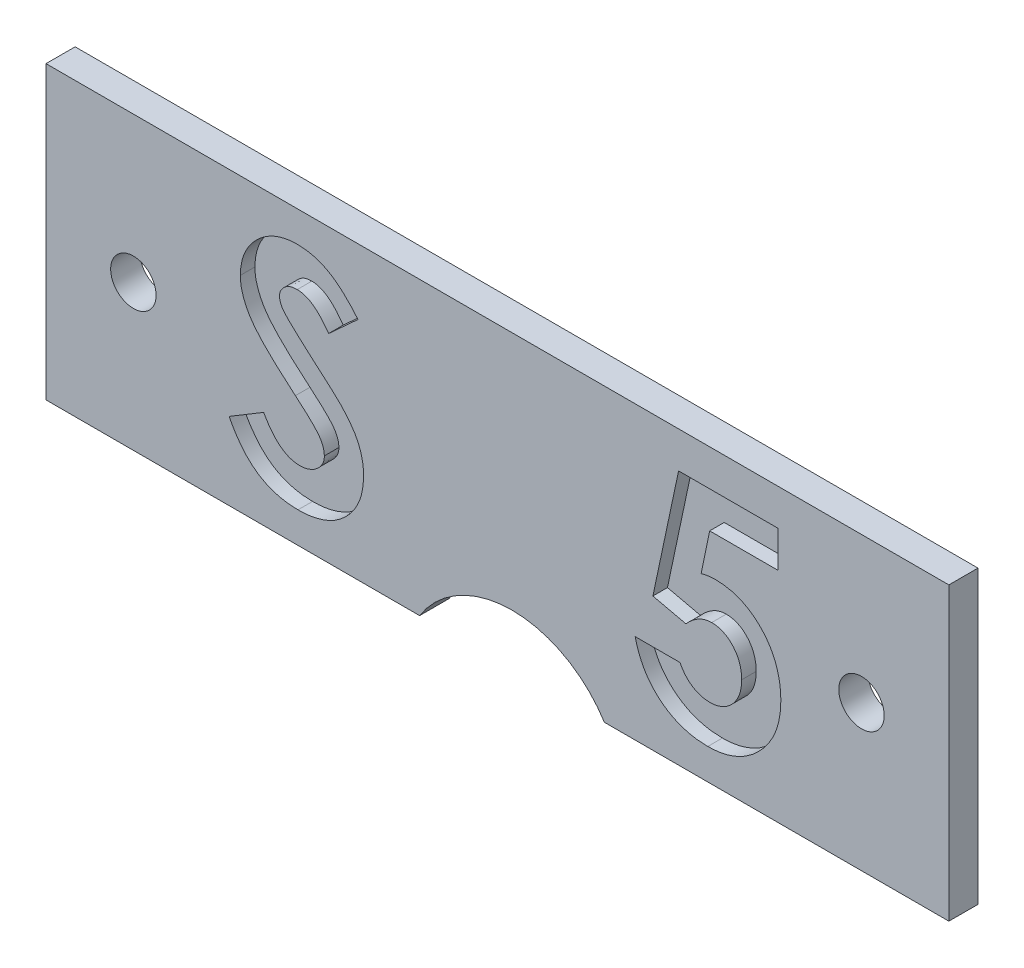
ISO-10303-21;
HEADER;
FILE_DESCRIPTION(('STEP AP214'),'2;1');
FILE_NAME('part.step','',(''),(''),'','','');
FILE_SCHEMA(('AUTOMOTIVE_DESIGN { 1 0 10303 214 1 1 1 1 }'));
ENDSEC;
DATA;
#1=APPLICATION_CONTEXT('core data for automotive mechanical design processes');
#2=APPLICATION_PROTOCOL_DEFINITION('international standard','automotive_design',2000,#1);
#3=PRODUCT_CONTEXT('',#1,'mechanical');
#4=PRODUCT('Part','Part','',(#3));
#5=PRODUCT_RELATED_PRODUCT_CATEGORY('part','',(#4));
#6=PRODUCT_DEFINITION_FORMATION('','',#4);
#7=PRODUCT_DEFINITION_CONTEXT('part definition',#1,'design');
#8=PRODUCT_DEFINITION('design','',#6,#7);
#9=PRODUCT_DEFINITION_SHAPE('','',#8);
#10=(LENGTH_UNIT() NAMED_UNIT(*) SI_UNIT(.MILLI.,.METRE.));
#11=(NAMED_UNIT(*) PLANE_ANGLE_UNIT() SI_UNIT($,.RADIAN.));
#12=(NAMED_UNIT(*) SI_UNIT($,.STERADIAN.) SOLID_ANGLE_UNIT());
#13=UNCERTAINTY_MEASURE_WITH_UNIT(LENGTH_MEASURE(1.E-05),#10,'distance_accuracy_value','');
#14=(GEOMETRIC_REPRESENTATION_CONTEXT(3) GLOBAL_UNCERTAINTY_ASSIGNED_CONTEXT((#13)) GLOBAL_UNIT_ASSIGNED_CONTEXT((#10,
#11,#12)) REPRESENTATION_CONTEXT('',''));
#15=CARTESIAN_POINT('',(0.,0.,0.));
#16=DIRECTION('',(0.,0.,1.));
#17=DIRECTION('',(1.,0.,0.));
#18=AXIS2_PLACEMENT_3D('',#15,#16,#17);
#19=CARTESIAN_POINT('',(0.,0.,2.54));
#20=DIRECTION('',(0.,1.,0.));
#21=DIRECTION('',(-1.,0.,0.));
#22=AXIS2_PLACEMENT_3D('',#19,#20,#21);
#23=PLANE('',#22);
#24=DIRECTION('',(1.,0.,0.));
#25=VECTOR('',#24,1.);
#26=CARTESIAN_POINT('',(0.,0.,0.));
#27=LINE('',#26,#25);
#28=CARTESIAN_POINT('',(-78.7400000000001,0.,0.));
#29=VERTEX_POINT('',#28);
#30=CARTESIAN_POINT('',(-46.1572467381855,0.,0.));
#31=VERTEX_POINT('',#30);
#32=EDGE_CURVE('E287',#29,#31,#27,.T.);
#33=ORIENTED_EDGE('',*,*,#32,.T.);
#34=DIRECTION('',(0.,0.,1.));
#35=VECTOR('',#34,1.);
#36=CARTESIAN_POINT('',(-46.1572467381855,0.,0.));
#37=LINE('',#36,#35);
#38=CARTESIAN_POINT('',(-46.1572467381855,0.,2.54));
#39=VERTEX_POINT('',#38);
#40=EDGE_CURVE('E41',#31,#39,#37,.T.);
#41=ORIENTED_EDGE('',*,*,#40,.T.);
#42=DIRECTION('',(1.,0.,0.));
#43=VECTOR('',#42,1.);
#44=CARTESIAN_POINT('',(0.,0.,2.54));
#45=LINE('',#44,#43);
#46=CARTESIAN_POINT('',(-78.7400000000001,0.,2.54));
#47=VERTEX_POINT('',#46);
#48=EDGE_CURVE('E301',#47,#39,#45,.T.);
#49=ORIENTED_EDGE('',*,*,#48,.F.);
#50=DIRECTION('',(0.,0.,-1.));
#51=VECTOR('',#50,1.);
#52=CARTESIAN_POINT('',(-78.7400000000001,0.,2.54));
#53=LINE('',#52,#51);
#54=EDGE_CURVE('E306',#47,#29,#53,.T.);
#55=ORIENTED_EDGE('',*,*,#54,.T.);
#56=EDGE_LOOP('',(#33,#41,#49,#55));
#57=FACE_BOUND('',#56,.T.);
#58=ADVANCED_FACE('F26',(#57),#23,.F.);
#59=CARTESIAN_POINT('',(0.,0.,2.54));
#60=DIRECTION('',(0.,0.,1.));
#61=DIRECTION('',(1.,0.,0.));
#62=AXIS2_PLACEMENT_3D('',#59,#60,#61);
#63=PLANE('',#62);
#64=CARTESIAN_POINT('',(-71.1200000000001,12.7,2.54));
#65=DIRECTION('',(0.,0.,1.));
#66=DIRECTION('',(1.,0.,0.));
#67=AXIS2_PLACEMENT_3D('',#64,#65,#66);
#68=CIRCLE('',#67,1.9812);
#69=CARTESIAN_POINT('',(-69.1388000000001,12.7,2.54));
#70=VERTEX_POINT('',#69);
#71=EDGE_CURVE('E1093',#70,#70,#68,.T.);
#72=ORIENTED_EDGE('',*,*,#71,.F.);
#73=EDGE_LOOP('',(#72));
#74=FACE_BOUND('',#73,.T.);
#75=CARTESIAN_POINT('',(-7.62000000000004,12.7,2.54));
#76=DIRECTION('',(0.,0.,1.));
#77=DIRECTION('',(1.,0.,0.));
#78=AXIS2_PLACEMENT_3D('',#75,#76,#77);
#79=CIRCLE('',#78,1.9812);
#80=CARTESIAN_POINT('',(-5.63880000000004,12.7,2.54));
#81=VERTEX_POINT('',#80);
#82=EDGE_CURVE('E716',#81,#81,#79,.T.);
#83=ORIENTED_EDGE('',*,*,#82,.F.);
#84=EDGE_LOOP('',(#83));
#85=FACE_BOUND('',#84,.T.);
#86=CARTESIAN_POINT('',(-38.1000000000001,-5.07999999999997,2.54));
#87=DIRECTION('',(0.,0.,1.));
#88=DIRECTION('',(1.,0.,0.));
#89=AXIS2_PLACEMENT_3D('',#86,#87,#88);
#90=CIRCLE('',#89,9.52500000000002);
#91=CARTESIAN_POINT('',(-30.0427532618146,0.,2.54));
#92=VERTEX_POINT('',#91);
#93=EDGE_CURVE('E273',#92,#39,#90,.T.);
#94=ORIENTED_EDGE('',*,*,#93,.F.);
#95=CARTESIAN_POINT('',(0.,0.,2.54));
#96=VERTEX_POINT('',#95);
#97=EDGE_CURVE('E281',#92,#96,#45,.T.);
#98=ORIENTED_EDGE('',*,*,#97,.T.);
#99=DIRECTION('',(0.,1.,0.));
#100=VECTOR('',#99,1.);
#101=CARTESIAN_POINT('',(0.,0.,2.54));
#102=LINE('',#101,#100);
#103=CARTESIAN_POINT('',(0.,25.4,2.54));
#104=VERTEX_POINT('',#103);
#105=EDGE_CURVE('E290',#96,#104,#102,.T.);
#106=ORIENTED_EDGE('',*,*,#105,.T.);
#107=DIRECTION('',(-1.,0.,0.));
#108=VECTOR('',#107,1.);
#109=CARTESIAN_POINT('',(0.,25.4,2.54));
#110=LINE('',#109,#108);
#111=CARTESIAN_POINT('',(-78.7400000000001,25.4,2.54));
#112=VERTEX_POINT('',#111);
#113=EDGE_CURVE('E297',#104,#112,#110,.T.);
#114=ORIENTED_EDGE('',*,*,#113,.T.);
#115=DIRECTION('',(0.,-1.,0.));
#116=VECTOR('',#115,1.);
#117=CARTESIAN_POINT('',(-78.7400000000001,0.,2.54));
#118=LINE('',#117,#116);
#119=EDGE_CURVE('E299',#112,#47,#118,.T.);
#120=ORIENTED_EDGE('',*,*,#119,.T.);
#121=ORIENTED_EDGE('',*,*,#48,.T.);
#122=EDGE_LOOP('',(#94,#98,#106,#114,#120,#121));
#123=FACE_BOUND('',#122,.T.);
#124=CARTESIAN_POINT('',(-61.7903846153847,17.8822716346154,2.54));
#125=CARTESIAN_POINT('',(-61.7862524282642,18.0453675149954,2.54));
#126=CARTESIAN_POINT('',(-61.7781115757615,18.3666839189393,2.54));
#127=CARTESIAN_POINT('',(-61.7054939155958,18.8391328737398,2.54));
#128=CARTESIAN_POINT('',(-61.5969640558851,19.2950064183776,2.54));
#129=CARTESIAN_POINT('',(-61.4393475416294,19.7326413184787,2.54));
#130=CARTESIAN_POINT('',(-61.23478033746,20.1514894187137,2.54));
#131=CARTESIAN_POINT('',(-60.9863414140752,20.5536011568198,2.54));
#132=CARTESIAN_POINT('',(-60.6901729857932,20.9352755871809,2.54));
#133=CARTESIAN_POINT('',(-60.3564111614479,21.2962596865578,2.54));
#134=CARTESIAN_POINT('',(-59.988691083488,21.6261580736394,2.54));
#135=CARTESIAN_POINT('',(-59.5957354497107,21.9173264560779,2.54));
#136=CARTESIAN_POINT('',(-59.1797684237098,22.1632515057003,2.54));
#137=CARTESIAN_POINT('',(-58.7433346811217,22.3672641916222,2.54));
#138=CARTESIAN_POINT('',(-58.2837298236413,22.5234229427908,2.54));
#139=CARTESIAN_POINT('',(-57.8043397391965,22.6341160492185,2.54));
#140=CARTESIAN_POINT('',(-57.3044768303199,22.6999527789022,2.54));
#141=CARTESIAN_POINT('',(-56.9644808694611,22.7089025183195,2.54));
#142=CARTESIAN_POINT('',(-56.7912860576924,22.7134615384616,2.54));
#143=B_SPLINE_CURVE_WITH_KNOTS('',3,(#124,#125,#126,#127,#128,#129,#130,#131,#132,#133,#134,
#135,#136,#137,#138,#139,#140,#141,#142),.UNSPECIFIED.,.F.,.F.,(4,1,1,1,1,1,1,1,1,1,1,1,1,1,1,1,
4),(0.,0.0631728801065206,0.124457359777,0.18484091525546,0.244566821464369,0.304319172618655,
0.365199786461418,0.427420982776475,0.491261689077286,0.555499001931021,0.618604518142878,
0.680494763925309,0.742473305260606,0.804990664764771,0.86825197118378,0.932887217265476,1.),.UNSPECIFIED.);
#144=CARTESIAN_POINT('',(-61.7903846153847,17.8822716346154,2.54));
#145=VERTEX_POINT('',#144);
#146=CARTESIAN_POINT('',(-56.7912860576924,22.7134615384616,2.54));
#147=VERTEX_POINT('',#146);
#148=EDGE_CURVE('E529',#145,#147,#143,.T.);
#149=ORIENTED_EDGE('',*,*,#148,.T.);
#150=CARTESIAN_POINT('',(-56.7912860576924,22.7134615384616,2.54));
#151=CARTESIAN_POINT('',(-56.5668341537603,22.70525060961,2.54));
#152=CARTESIAN_POINT('',(-56.1197020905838,22.6888935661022,2.54));
#153=CARTESIAN_POINT('',(-55.4586044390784,22.5609868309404,2.54));
#154=CARTESIAN_POINT('',(-54.8128718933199,22.359840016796,2.54));
#155=CARTESIAN_POINT('',(-54.292528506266,22.1171785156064,2.54));
#156=CARTESIAN_POINT('',(-53.8785009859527,21.8821122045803,2.54));
#157=CARTESIAN_POINT('',(-53.5611875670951,21.66569275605,2.54));
#158=CARTESIAN_POINT('',(-53.2383040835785,21.4177726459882,2.54));
#159=CARTESIAN_POINT('',(-52.9072466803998,21.1375706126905,2.54));
#160=CARTESIAN_POINT('',(-52.5741669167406,20.8198072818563,2.54));
#161=CARTESIAN_POINT('',(-52.2295937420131,20.4720472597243,2.54));
#162=CARTESIAN_POINT('',(-51.8782223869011,20.0912850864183,2.54));
#163=CARTESIAN_POINT('',(-51.6498867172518,19.8192703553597,2.54));
#164=CARTESIAN_POINT('',(-51.5326923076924,19.6796574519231,2.54));
#165=B_SPLINE_CURVE_WITH_KNOTS('',3,(#150,#151,#152,#153,#154,#155,#156,#157,#158,#159,#160,
#161,#162,#163,#164),.UNSPECIFIED.,.F.,.F.,(4,1,1,1,1,1,1,1,1,1,1,1,4),(0.,0.1069102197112,
0.212976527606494,0.319776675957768,0.428556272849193,0.485856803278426,0.546558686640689,
0.611431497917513,0.679820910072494,0.753158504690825,0.830752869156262,0.913133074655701,1.),.UNSPECIFIED.);
#166=CARTESIAN_POINT('',(-51.5326923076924,19.6796574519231,2.54));
#167=VERTEX_POINT('',#166);
#168=EDGE_CURVE('E651',#147,#167,#165,.T.);
#169=ORIENTED_EDGE('',*,*,#168,.T.);
#170=DIRECTION('',(-0.73779374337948,-0.675026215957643,0.));
#171=VECTOR('',#170,1.);
#172=CARTESIAN_POINT('',(-51.5326923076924,19.6796574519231,2.54));
#173=LINE('',#172,#171);
#174=CARTESIAN_POINT('',(-54.089483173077,17.3403846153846,2.54));
#175=VERTEX_POINT('',#174);
#176=EDGE_CURVE('E999',#167,#175,#173,.T.);
#177=ORIENTED_EDGE('',*,*,#176,.T.);
#178=CARTESIAN_POINT('',(-54.089483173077,17.3403846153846,2.54));
#179=CARTESIAN_POINT('',(-54.1990051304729,17.4948767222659,2.54));
#180=CARTESIAN_POINT('',(-54.4092720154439,17.7914800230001,2.54));
#181=CARTESIAN_POINT('',(-54.7500927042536,18.188638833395,2.54));
#182=CARTESIAN_POINT('',(-55.0893744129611,18.5274448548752,2.54));
#183=CARTESIAN_POINT('',(-55.430260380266,18.8064827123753,2.54));
#184=CARTESIAN_POINT('',(-55.775772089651,19.0240570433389,2.54));
#185=CARTESIAN_POINT('',(-56.1253097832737,19.178102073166,2.54));
#186=CARTESIAN_POINT('',(-56.4768918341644,19.2760299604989,2.54));
#187=CARTESIAN_POINT('',(-56.7131007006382,19.2882243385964,2.54));
#188=CARTESIAN_POINT('',(-56.8294471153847,19.2942307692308,2.54));
#189=B_SPLINE_CURVE_WITH_KNOTS('',3,(#178,#179,#180,#181,#182,#183,#184,#185,#186,#187,#188),
.UNSPECIFIED.,.F.,.F.,(4,1,1,1,1,1,1,1,4),(0.,0.162420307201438,0.311824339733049,
0.448432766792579,0.573381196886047,0.689077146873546,0.797572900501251,0.900293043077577,1.),.UNSPECIFIED.);
#190=CARTESIAN_POINT('',(-56.8294471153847,19.2942307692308,2.54));
#191=VERTEX_POINT('',#190);
#192=EDGE_CURVE('E568',#175,#191,#189,.T.);
#193=ORIENTED_EDGE('',*,*,#192,.T.);
#194=CARTESIAN_POINT('',(-56.8294471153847,19.2942307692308,2.54));
#195=CARTESIAN_POINT('',(-56.9379717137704,19.2904248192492,2.54));
#196=CARTESIAN_POINT('',(-57.1475042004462,19.2830765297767,2.54));
#197=CARTESIAN_POINT('',(-57.4462083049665,19.2100350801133,2.54));
#198=CARTESIAN_POINT('',(-57.7114020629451,19.0839762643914,2.54));
#199=CARTESIAN_POINT('',(-57.9428266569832,18.9191437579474,2.54));
#200=CARTESIAN_POINT('',(-58.1261490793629,18.720558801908,2.54));
#201=CARTESIAN_POINT('',(-58.2725178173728,18.5122942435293,2.54));
#202=CARTESIAN_POINT('',(-58.3549357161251,18.2824172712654,2.54));
#203=CARTESIAN_POINT('',(-58.3657835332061,18.124528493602,2.54));
#204=CARTESIAN_POINT('',(-58.3711538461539,18.0463641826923,2.54));
#205=B_SPLINE_CURVE_WITH_KNOTS('',3,(#194,#195,#196,#197,#198,#199,#200,#201,#202,#203,#204),
.UNSPECIFIED.,.F.,.F.,(4,1,1,1,1,1,1,1,4),(0.,0.148126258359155,0.285992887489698,
0.416634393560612,0.547379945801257,0.671582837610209,0.784400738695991,0.893265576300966,1.),.UNSPECIFIED.);
#206=CARTESIAN_POINT('',(-58.3711538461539,18.0463641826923,2.54));
#207=VERTEX_POINT('',#206);
#208=EDGE_CURVE('E546',#191,#207,#205,.T.);
#209=ORIENTED_EDGE('',*,*,#208,.T.);
#210=CARTESIAN_POINT('',(-58.3711538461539,18.0463641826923,2.54));
#211=CARTESIAN_POINT('',(-58.3677885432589,17.9670727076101,2.54));
#212=CARTESIAN_POINT('',(-58.361011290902,17.8073906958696,2.54));
#213=CARTESIAN_POINT('',(-58.2955522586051,17.5733568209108,2.54));
#214=CARTESIAN_POINT('',(-58.1968868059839,17.3446784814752,2.54));
#215=CARTESIAN_POINT('',(-58.1026079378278,17.2054710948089,2.54));
#216=CARTESIAN_POINT('',(-58.0544170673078,17.1343149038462,2.54));
#217=B_SPLINE_CURVE_WITH_KNOTS('',3,(#210,#211,#212,#213,#214,#215,#216),.UNSPECIFIED.,.F.,.F.,
(4,1,1,1,4),(0.,0.241881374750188,0.487115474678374,0.737837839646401,1.),.UNSPECIFIED.);
#218=CARTESIAN_POINT('',(-58.0544170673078,17.1343149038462,2.54));
#219=VERTEX_POINT('',#218);
#220=EDGE_CURVE('E563',#207,#219,#217,.T.);
#221=ORIENTED_EDGE('',*,*,#220,.T.);
#222=CARTESIAN_POINT('',(-58.0544170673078,17.1343149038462,2.54));
#223=CARTESIAN_POINT('',(-58.0106063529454,17.079005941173,2.54));
#224=CARTESIAN_POINT('',(-57.9097598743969,16.9516920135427,2.54));
#225=CARTESIAN_POINT('',(-57.717466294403,16.750046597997,2.54));
#226=CARTESIAN_POINT('',(-57.4759859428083,16.5030133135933,2.54));
#227=CARTESIAN_POINT('',(-57.17602614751,16.2190869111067,2.54));
#228=CARTESIAN_POINT('',(-56.8300390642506,15.8880562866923,2.54));
#229=CARTESIAN_POINT('',(-56.4219877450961,15.5229343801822,2.54));
#230=CARTESIAN_POINT('',(-55.963617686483,15.1124137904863,2.54));
#231=CARTESIAN_POINT('',(-55.6378188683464,14.8265421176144,2.54));
#232=CARTESIAN_POINT('',(-55.4670973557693,14.6767427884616,2.54));
#233=B_SPLINE_CURVE_WITH_KNOTS('',3,(#222,#223,#224,#225,#226,#227,#228,#229,#230,#231,#232),
.UNSPECIFIED.,.F.,.F.,(4,1,1,1,1,1,1,1,4),(0.,0.0592341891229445,0.13634928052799,
0.233805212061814,0.349411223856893,0.483179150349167,0.635966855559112,0.80924335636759,1.),.UNSPECIFIED.);
#234=CARTESIAN_POINT('',(-55.4670973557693,14.6767427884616,2.54));
#235=VERTEX_POINT('',#234);
#236=EDGE_CURVE('E558',#219,#235,#233,.T.);
#237=ORIENTED_EDGE('',*,*,#236,.T.);
#238=CARTESIAN_POINT('',(-55.4670973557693,14.6767427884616,2.54));
#239=CARTESIAN_POINT('',(-55.3068506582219,14.5380573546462,2.54));
#240=CARTESIAN_POINT('',(-55.002735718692,14.2748612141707,2.54));
#241=CARTESIAN_POINT('',(-54.5700405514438,13.901296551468,2.54));
#242=CARTESIAN_POINT('',(-54.1897735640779,13.5652095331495,2.54));
#243=CARTESIAN_POINT('',(-53.8563951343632,13.2716441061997,2.54));
#244=CARTESIAN_POINT('',(-53.5749589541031,13.0175200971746,2.54));
#245=CARTESIAN_POINT('',(-53.344281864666,12.8016227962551,2.54));
#246=CARTESIAN_POINT('',(-53.1615465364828,12.6281553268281,2.54));
#247=CARTESIAN_POINT('',(-53.0576722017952,12.5233808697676,2.54));
#248=CARTESIAN_POINT('',(-53.0133413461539,12.4786658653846,2.54));
#249=B_SPLINE_CURVE_WITH_KNOTS('',3,(#238,#239,#240,#241,#242,#243,#244,#245,#246,#247,#248),
.UNSPECIFIED.,.F.,.F.,(4,1,1,1,1,1,1,1,4),(0.,0.192952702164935,0.366184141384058,
0.520457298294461,0.65501213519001,0.770624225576,0.865677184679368,0.942674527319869,1.),.UNSPECIFIED.);
#250=CARTESIAN_POINT('',(-53.0133413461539,12.4786658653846,2.54));
#251=VERTEX_POINT('',#250);
#252=EDGE_CURVE('E562',#235,#251,#249,.T.);
#253=ORIENTED_EDGE('',*,*,#252,.T.);
#254=CARTESIAN_POINT('',(-53.0133413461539,12.4786658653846,2.54));
#255=CARTESIAN_POINT('',(-52.8451593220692,12.2966568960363,2.54));
#256=CARTESIAN_POINT('',(-52.5218544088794,11.9467717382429,2.54));
#257=CARTESIAN_POINT('',(-52.1016719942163,11.4045597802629,2.54));
#258=CARTESIAN_POINT('',(-51.7558482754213,10.8752503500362,2.54));
#259=CARTESIAN_POINT('',(-51.4883124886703,10.3488836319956,2.54));
#260=CARTESIAN_POINT('',(-51.2862587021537,9.81786520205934,2.54));
#261=CARTESIAN_POINT('',(-51.1438081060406,9.26917186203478,2.54));
#262=CARTESIAN_POINT('',(-51.0584934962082,8.69707011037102,2.54));
#263=CARTESIAN_POINT('',(-51.0490215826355,8.30668050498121,2.54));
#264=CARTESIAN_POINT('',(-51.0442307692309,8.10922475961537,2.54));
#265=B_SPLINE_CURVE_WITH_KNOTS('',3,(#254,#255,#256,#257,#258,#259,#260,#261,#262,#263,#264),
.UNSPECIFIED.,.F.,.F.,(4,1,1,1,1,1,1,1,4),(0.,0.150833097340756,0.289954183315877,
0.417138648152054,0.535255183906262,0.648751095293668,0.762405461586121,0.879826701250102,1.),.UNSPECIFIED.);
#266=CARTESIAN_POINT('',(-51.0442307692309,8.10922475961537,2.54));
#267=VERTEX_POINT('',#266);
#268=EDGE_CURVE('E587',#251,#267,#265,.T.);
#269=ORIENTED_EDGE('',*,*,#268,.T.);
#270=CARTESIAN_POINT('',(-51.0442307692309,8.10922475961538,2.54));
#271=CARTESIAN_POINT('',(-51.0476407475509,7.9168283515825,2.54));
#272=CARTESIAN_POINT('',(-51.0543312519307,7.53933943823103,2.54));
#273=CARTESIAN_POINT('',(-51.1362771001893,6.98694064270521,2.54));
#274=CARTESIAN_POINT('',(-51.2531270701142,6.45827102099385,2.54));
#275=CARTESIAN_POINT('',(-51.4337976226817,5.95908324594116,2.54));
#276=CARTESIAN_POINT('',(-51.6539978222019,5.48118330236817,2.54));
#277=CARTESIAN_POINT('',(-51.9300505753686,5.03201535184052,2.54));
#278=CARTESIAN_POINT('',(-52.254236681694,4.60703363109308,2.54));
#279=CARTESIAN_POINT('',(-52.6258037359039,4.21383520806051,2.54));
#280=CARTESIAN_POINT('',(-53.0368010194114,3.85703489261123,2.54));
#281=CARTESIAN_POINT('',(-53.47763466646,3.53940282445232,2.54));
#282=CARTESIAN_POINT('',(-53.9526153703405,3.27715709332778,2.54));
#283=CARTESIAN_POINT('',(-54.4576849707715,3.06121643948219,2.54));
#284=CARTESIAN_POINT('',(-54.9925731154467,2.8948960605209,2.54));
#285=CARTESIAN_POINT('',(-55.5566425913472,2.77196979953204,2.54));
#286=CARTESIAN_POINT('',(-56.1507561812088,2.6981913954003,2.54));
#287=CARTESIAN_POINT('',(-56.5570196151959,2.69047873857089,2.54));
#288=CARTESIAN_POINT('',(-56.7645733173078,2.68653846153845,2.54));
#289=B_SPLINE_CURVE_WITH_KNOTS('',3,(#270,#271,#272,#273,#274,#275,#276,#277,#278,#279,#280,
#281,#282,#283,#284,#285,#286,#287,#288),.UNSPECIFIED.,.F.,.F.,(4,1,1,1,1,1,1,1,1,1,1,1,1,1,1,1,
4),(0.,0.0652008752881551,0.127926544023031,0.189046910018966,0.248543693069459,
0.307607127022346,0.367247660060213,0.426963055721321,0.488617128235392,0.550391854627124,
0.61133073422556,0.672556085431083,0.734024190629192,0.797340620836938,0.862249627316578,
0.929625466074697,1.),.UNSPECIFIED.);
#290=CARTESIAN_POINT('',(-56.7645733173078,2.68653846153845,2.54));
#291=VERTEX_POINT('',#290);
#292=EDGE_CURVE('E595',#267,#291,#289,.T.);
#293=ORIENTED_EDGE('',*,*,#292,.T.);
#294=CARTESIAN_POINT('',(-56.7645733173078,2.68653846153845,2.54));
#295=CARTESIAN_POINT('',(-56.927501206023,2.68942891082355,2.54));
#296=CARTESIAN_POINT('',(-57.2501918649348,2.69515365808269,2.54));
#297=CARTESIAN_POINT('',(-57.7257891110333,2.74189145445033,2.54));
#298=CARTESIAN_POINT('',(-58.1850320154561,2.81732128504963,2.54));
#299=CARTESIAN_POINT('',(-58.6274032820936,2.92543476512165,2.54));
#300=CARTESIAN_POINT('',(-59.0548958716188,3.06242920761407,2.54));
#301=CARTESIAN_POINT('',(-59.4675273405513,3.22976267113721,2.54));
#302=CARTESIAN_POINT('',(-59.8624491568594,3.4300287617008,2.54));
#303=CARTESIAN_POINT('',(-60.2426494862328,3.65910921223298,2.54));
#304=CARTESIAN_POINT('',(-60.606280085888,3.92510179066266,2.54));
#305=CARTESIAN_POINT('',(-60.957938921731,4.22256836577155,2.54));
#306=CARTESIAN_POINT('',(-61.2941329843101,4.55608410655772,2.54));
#307=CARTESIAN_POINT('',(-61.6164769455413,4.92486026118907,2.54));
#308=CARTESIAN_POINT('',(-61.9229083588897,5.32994111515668,2.54));
#309=CARTESIAN_POINT('',(-62.2234578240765,5.76568516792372,2.54));
#310=CARTESIAN_POINT('',(-62.5047680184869,6.24017923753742,2.54));
#311=CARTESIAN_POINT('',(-62.6785458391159,6.57304066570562,2.54));
#312=CARTESIAN_POINT('',(-62.7673076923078,6.74305889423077,2.54));
#313=B_SPLINE_CURVE_WITH_KNOTS('',3,(#294,#295,#296,#297,#298,#299,#300,#301,#302,#303,#304,
#305,#306,#307,#308,#309,#310,#311,#312),.UNSPECIFIED.,.F.,.F.,(4,1,1,1,1,1,1,1,1,1,1,1,1,1,1,1,
4),(0.,0.0635514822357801,0.125868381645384,0.186240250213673,0.244976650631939,
0.30335768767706,0.361230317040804,0.418489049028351,0.475936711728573,0.534203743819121,
0.594059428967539,0.655468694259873,0.718771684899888,0.784974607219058,0.853522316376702,
0.925182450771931,1.),.UNSPECIFIED.);
#314=CARTESIAN_POINT('',(-62.7673076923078,6.74305889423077,2.54));
#315=VERTEX_POINT('',#314);
#316=EDGE_CURVE('E603',#291,#315,#313,.T.);
#317=ORIENTED_EDGE('',*,*,#316,.T.);
#318=DIRECTION('',(0.857396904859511,0.514655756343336,0.));
#319=VECTOR('',#318,1.);
#320=CARTESIAN_POINT('',(-62.7673076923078,6.74305889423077,2.54));
#321=LINE('',#320,#319);
#322=CARTESIAN_POINT('',(-59.7602163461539,8.54807692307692,2.54));
#323=VERTEX_POINT('',#322);
#324=EDGE_CURVE('E611',#315,#323,#321,.T.);
#325=ORIENTED_EDGE('',*,*,#324,.T.);
#326=CARTESIAN_POINT('',(-59.7602163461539,8.54807692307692,2.54));
#327=CARTESIAN_POINT('',(-59.6491885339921,8.35508401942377,2.54));
#328=CARTESIAN_POINT('',(-59.4363387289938,7.98510012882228,2.54));
#329=CARTESIAN_POINT('',(-59.0756448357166,7.48797987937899,2.54));
#330=CARTESIAN_POINT('',(-58.7061323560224,7.06227867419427,2.54));
#331=CARTESIAN_POINT('',(-58.3192584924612,6.71552080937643,2.54));
#332=CARTESIAN_POINT('',(-57.919727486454,6.4430696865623,2.54));
#333=CARTESIAN_POINT('',(-57.5056095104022,6.24835721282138,2.54));
#334=CARTESIAN_POINT('',(-57.076613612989,6.12783041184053,2.54));
#335=CARTESIAN_POINT('',(-56.7844010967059,6.11311130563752,2.54));
#336=CARTESIAN_POINT('',(-56.6386418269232,6.10576923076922,2.54));
#337=B_SPLINE_CURVE_WITH_KNOTS('',3,(#326,#327,#328,#329,#330,#331,#332,#333,#334,#335,#336),
.UNSPECIFIED.,.F.,.F.,(4,1,1,1,1,1,1,1,4),(0.,0.160457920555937,0.307611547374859,
0.442138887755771,0.566229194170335,0.681222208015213,0.789558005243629,0.895028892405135,1.),.UNSPECIFIED.);
#338=CARTESIAN_POINT('',(-56.6386418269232,6.10576923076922,2.54));
#339=VERTEX_POINT('',#338);
#340=EDGE_CURVE('E617',#323,#339,#337,.T.);
#341=ORIENTED_EDGE('',*,*,#340,.T.);
#342=CARTESIAN_POINT('',(-56.6386418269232,6.10576923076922,2.54));
#343=CARTESIAN_POINT('',(-56.4903837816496,6.11176516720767,2.54));
#344=CARTESIAN_POINT('',(-56.2027415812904,6.1233981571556,2.54));
#345=CARTESIAN_POINT('',(-55.7921691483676,6.23084857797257,2.54));
#346=CARTESIAN_POINT('',(-55.4157407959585,6.39955362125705,2.54));
#347=CARTESIAN_POINT('',(-55.090358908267,6.64027245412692,2.54));
#348=CARTESIAN_POINT('',(-54.8148460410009,6.9180985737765,2.54));
#349=CARTESIAN_POINT('',(-54.6115017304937,7.22719283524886,2.54));
#350=CARTESIAN_POINT('',(-54.4837594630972,7.56162536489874,2.54));
#351=CARTESIAN_POINT('',(-54.4702540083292,7.79394419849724,2.54));
#352=CARTESIAN_POINT('',(-54.4634615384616,7.91078725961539,2.54));
#353=B_SPLINE_CURVE_WITH_KNOTS('',3,(#342,#343,#344,#345,#346,#347,#348,#349,#350,#351,#352),
.UNSPECIFIED.,.F.,.F.,(4,1,1,1,1,1,1,1,4),(0.,0.141985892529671,0.275473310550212,
0.404345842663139,0.535429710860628,0.661427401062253,0.77786684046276,0.888279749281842,1.),.UNSPECIFIED.);
#354=CARTESIAN_POINT('',(-54.4634615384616,7.91078725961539,2.54));
#355=VERTEX_POINT('',#354);
#356=EDGE_CURVE('E622',#339,#355,#353,.T.);
#357=ORIENTED_EDGE('',*,*,#356,.T.);
#358=CARTESIAN_POINT('',(-54.4634615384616,7.91078725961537,2.54));
#359=CARTESIAN_POINT('',(-54.4697341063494,8.01949071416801,2.54));
#360=CARTESIAN_POINT('',(-54.4824762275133,8.24031137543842,2.54));
#361=CARTESIAN_POINT('',(-54.5763307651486,8.56863619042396,2.54));
#362=CARTESIAN_POINT('',(-54.723054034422,8.89681169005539,2.54));
#363=CARTESIAN_POINT('',(-54.8966380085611,9.16599011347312,2.54));
#364=CARTESIAN_POINT('',(-55.0732814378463,9.3913659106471,2.54));
#365=CARTESIAN_POINT('',(-55.2421923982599,9.58664384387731,2.54));
#366=CARTESIAN_POINT('',(-55.4478812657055,9.80239177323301,2.54));
#367=CARTESIAN_POINT('',(-55.6898265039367,10.0388810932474,2.54));
#368=CARTESIAN_POINT('',(-55.9648313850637,10.298193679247,2.54));
#369=CARTESIAN_POINT('',(-56.2731275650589,10.5803041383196,2.54));
#370=CARTESIAN_POINT('',(-56.618245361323,10.8827274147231,2.54));
#371=CARTESIAN_POINT('',(-56.8621753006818,11.0887351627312,2.54));
#372=CARTESIAN_POINT('',(-56.9897235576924,11.1964543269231,2.54));
#373=B_SPLINE_CURVE_WITH_KNOTS('',3,(#358,#359,#360,#361,#362,#363,#364,#365,#366,#367,#368,
#369,#370,#371,#372),.UNSPECIFIED.,.F.,.F.,(4,1,1,1,1,1,1,1,1,1,1,1,4),(0.,0.0763466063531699,
0.155090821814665,0.238351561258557,0.328404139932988,0.37938385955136,0.439617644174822,
0.509831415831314,0.588874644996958,0.67743635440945,0.775546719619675,0.882635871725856,1.),.UNSPECIFIED.);
#374=CARTESIAN_POINT('',(-56.9897235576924,11.1964543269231,2.54));
#375=VERTEX_POINT('',#374);
#376=EDGE_CURVE('E630',#355,#375,#373,.T.);
#377=ORIENTED_EDGE('',*,*,#376,.T.);
#378=CARTESIAN_POINT('',(-56.9897235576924,11.1964543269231,2.54));
#379=CARTESIAN_POINT('',(-57.2321978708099,11.4016108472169,2.54));
#380=CARTESIAN_POINT('',(-57.6975794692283,11.7953683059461,2.54));
#381=CARTESIAN_POINT('',(-58.3552227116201,12.3769356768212,2.54));
#382=CARTESIAN_POINT('',(-58.9478181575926,12.9204636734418,2.54));
#383=CARTESIAN_POINT('',(-59.4702475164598,13.4326714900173,2.54));
#384=CARTESIAN_POINT('',(-59.9291673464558,13.9040998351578,2.54));
#385=CARTESIAN_POINT('',(-60.3214696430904,14.3385778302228,2.54));
#386=CARTESIAN_POINT('',(-60.6428447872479,14.7394568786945,2.54));
#387=CARTESIAN_POINT('',(-60.9810228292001,15.2142712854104,2.54));
#388=CARTESIAN_POINT('',(-61.3023595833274,15.7928652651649,2.54));
#389=CARTESIAN_POINT('',(-61.5800857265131,16.4889808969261,2.54));
#390=CARTESIAN_POINT('',(-61.7602627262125,17.1850082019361,2.54));
#391=CARTESIAN_POINT('',(-61.7804490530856,17.6522825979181,2.54));
#392=CARTESIAN_POINT('',(-61.7903846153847,17.8822716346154,2.54));
#393=B_SPLINE_CURVE_WITH_KNOTS('',3,(#378,#379,#380,#381,#382,#383,#384,#385,#386,#387,#388,
#389,#390,#391,#392),.UNSPECIFIED.,.F.,.F.,(4,1,1,1,1,1,1,1,1,1,1,1,4),(0.,0.112124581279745,
0.215201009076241,0.309902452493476,0.395959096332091,0.473447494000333,0.542140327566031,
0.602523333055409,0.654726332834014,0.747804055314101,0.835278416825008,0.918925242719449,1.),.UNSPECIFIED.);
#394=EDGE_CURVE('E637',#375,#145,#393,.T.);
#395=ORIENTED_EDGE('',*,*,#394,.T.);
#396=EDGE_LOOP('',(#149,#169,#177,#193,#209,#221,#237,#253,#269,#293,#317,#325,#341,#357,#377,#395));
#397=FACE_BOUND('',#396,.T.);
#398=DIRECTION('',(-0.974673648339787,0.223632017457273,0.));
#399=VECTOR('',#398,1.);
#400=CARTESIAN_POINT('',(-22.934795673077,10.9942007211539,2.54));
#401=LINE('',#400,#399);
#402=CARTESIAN_POINT('',(-22.934795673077,10.9942007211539,2.54));
#403=VERTEX_POINT('',#402);
#404=CARTESIAN_POINT('',(-25.812139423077,11.6543870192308,2.54));
#405=VERTEX_POINT('',#404);
#406=EDGE_CURVE('E801',#403,#405,#401,.T.);
#407=ORIENTED_EDGE('',*,*,#406,.T.);
#408=DIRECTION('',(0.207309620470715,0.978275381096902,0.));
#409=VECTOR('',#408,1.);
#410=CARTESIAN_POINT('',(-25.812139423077,11.6543870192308,2.54));
#411=LINE('',#410,#409);
#412=CARTESIAN_POINT('',(-23.5720853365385,22.225,2.54));
#413=VERTEX_POINT('',#412);
#414=EDGE_CURVE('E49',#405,#413,#411,.T.);
#415=ORIENTED_EDGE('',*,*,#414,.T.);
#416=DIRECTION('',(1.,0.,0.));
#417=VECTOR('',#416,1.);
#418=CARTESIAN_POINT('',(-23.5720853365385,22.225,2.54));
#419=LINE('',#418,#417);
#420=CARTESIAN_POINT('',(-14.898076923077,22.225,2.54));
#421=VERTEX_POINT('',#420);
#422=EDGE_CURVE('E725',#413,#421,#419,.T.);
#423=ORIENTED_EDGE('',*,*,#422,.T.);
#424=DIRECTION('',(0.,-1.,0.));
#425=VECTOR('',#424,1.);
#426=CARTESIAN_POINT('',(-14.898076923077,22.225,2.54));
#427=LINE('',#426,#425);
#428=CARTESIAN_POINT('',(-14.898076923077,19.05,2.54));
#429=VERTEX_POINT('',#428);
#430=EDGE_CURVE('E728',#421,#429,#427,.T.);
#431=ORIENTED_EDGE('',*,*,#430,.T.);
#432=DIRECTION('',(-1.,0.,0.));
#433=VECTOR('',#432,1.);
#434=CARTESIAN_POINT('',(-14.898076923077,19.05,2.54));
#435=LINE('',#434,#433);
#436=CARTESIAN_POINT('',(-20.8626502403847,19.05,2.54));
#437=VERTEX_POINT('',#436);
#438=EDGE_CURVE('E731',#429,#437,#435,.T.);
#439=ORIENTED_EDGE('',*,*,#438,.T.);
#440=DIRECTION('',(-0.202296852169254,-0.97932424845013,0.));
#441=VECTOR('',#440,1.);
#442=CARTESIAN_POINT('',(-20.8626502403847,19.05,2.54));
#443=LINE('',#442,#441);
#444=CARTESIAN_POINT('',(-21.6067908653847,15.4475961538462,2.54));
#445=VERTEX_POINT('',#444);
#446=EDGE_CURVE('E734',#437,#445,#443,.T.);
#447=ORIENTED_EDGE('',*,*,#446,.T.);
#448=CARTESIAN_POINT('',(-21.6067908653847,15.4475961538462,2.54));
#449=CARTESIAN_POINT('',(-21.5053910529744,15.4758372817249,2.54));
#450=CARTESIAN_POINT('',(-21.3054097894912,15.5315345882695,2.54));
#451=CARTESIAN_POINT('',(-21.0041377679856,15.5873919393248,2.54));
#452=CARTESIAN_POINT('',(-20.7121631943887,15.6235968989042,2.54));
#453=CARTESIAN_POINT('',(-20.5205712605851,15.6284261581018,2.54));
#454=CARTESIAN_POINT('',(-20.4276141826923,15.6307692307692,2.54));
#455=B_SPLINE_CURVE_WITH_KNOTS('',3,(#448,#449,#450,#451,#452,#453,#454),.UNSPECIFIED.,.F.,.F.,
(4,1,1,1,4),(0.,0.263654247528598,0.519980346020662,0.767102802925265,1.),.UNSPECIFIED.);
#456=CARTESIAN_POINT('',(-20.4276141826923,15.6307692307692,2.54));
#457=VERTEX_POINT('',#456);
#458=EDGE_CURVE('E737',#445,#457,#455,.T.);
#459=ORIENTED_EDGE('',*,*,#458,.T.);
#460=CARTESIAN_POINT('',(-20.4276141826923,15.6307692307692,2.54));
#461=CARTESIAN_POINT('',(-20.2250509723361,15.6261276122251,2.54));
#462=CARTESIAN_POINT('',(-19.8257542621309,15.6169779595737,2.54));
#463=CARTESIAN_POINT('',(-19.2416338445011,15.5301179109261,2.54));
#464=CARTESIAN_POINT('',(-18.6823040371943,15.3933159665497,2.54));
#465=CARTESIAN_POINT('',(-18.1494764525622,15.1982081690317,2.54));
#466=CARTESIAN_POINT('',(-17.6436715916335,14.9442703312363,2.54));
#467=CARTESIAN_POINT('',(-17.164276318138,14.6370767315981,2.54));
#468=CARTESIAN_POINT('',(-16.7107022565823,14.2760878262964,2.54));
#469=CARTESIAN_POINT('',(-16.2910067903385,13.8610776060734,2.54));
#470=CARTESIAN_POINT('',(-15.905373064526,13.4053869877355,2.54));
#471=CARTESIAN_POINT('',(-15.5700865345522,12.9125093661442,2.54));
#472=CARTESIAN_POINT('',(-15.2837309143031,12.3894726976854,2.54));
#473=CARTESIAN_POINT('',(-15.0559735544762,11.8330257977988,2.54));
#474=CARTESIAN_POINT('',(-14.8762080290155,11.2466635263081,2.54));
#475=CARTESIAN_POINT('',(-14.7463054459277,10.6300101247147,2.54));
#476=CARTESIAN_POINT('',(-14.6694875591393,9.98233476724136,2.54));
#477=CARTESIAN_POINT('',(-14.6591291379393,9.54047217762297,2.54));
#478=CARTESIAN_POINT('',(-14.6538461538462,9.31511418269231,2.54));
#479=B_SPLINE_CURVE_WITH_KNOTS('',3,(#460,#461,#462,#463,#464,#465,#466,#467,#468,#469,#470,
#471,#472,#473,#474,#475,#476,#477,#478),.UNSPECIFIED.,.F.,.F.,(4,1,1,1,1,1,1,1,1,1,1,1,1,1,1,1,
4),(0.,0.0634005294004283,0.124976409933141,0.184492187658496,0.243473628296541,
0.302263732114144,0.361383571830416,0.421481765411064,0.483454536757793,0.545936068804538,
0.608142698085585,0.66982029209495,0.732332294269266,0.79609223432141,0.861642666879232,
0.929435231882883,1.),.UNSPECIFIED.);
#480=CARTESIAN_POINT('',(-14.6538461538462,9.31511418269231,2.54));
#481=VERTEX_POINT('',#480);
#482=EDGE_CURVE('E742',#457,#481,#479,.T.);
#483=ORIENTED_EDGE('',*,*,#482,.T.);
#484=CARTESIAN_POINT('',(-14.6538461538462,9.31511418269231,2.54));
#485=CARTESIAN_POINT('',(-14.6603020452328,9.08719785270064,2.54));
#486=CARTESIAN_POINT('',(-14.6730414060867,8.63745231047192,2.54));
#487=CARTESIAN_POINT('',(-14.7561540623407,7.97616727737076,2.54));
#488=CARTESIAN_POINT('',(-14.9028493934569,7.3428055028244,2.54));
#489=CARTESIAN_POINT('',(-15.1043501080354,6.73567149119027,2.54));
#490=CARTESIAN_POINT('',(-15.3698144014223,6.15922753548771,2.54));
#491=CARTESIAN_POINT('',(-15.6890715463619,5.60750210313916,2.54));
#492=CARTESIAN_POINT('',(-16.067519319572,5.08459047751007,2.54));
#493=CARTESIAN_POINT('',(-16.5014438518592,4.59585313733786,2.54));
#494=CARTESIAN_POINT('',(-16.973176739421,4.14913782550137,2.54));
#495=CARTESIAN_POINT('',(-17.475460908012,3.75616150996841,2.54));
#496=CARTESIAN_POINT('',(-18.0047676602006,3.42547512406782,2.54));
#497=CARTESIAN_POINT('',(-18.5611097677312,3.15822461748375,2.54));
#498=CARTESIAN_POINT('',(-19.1412953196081,2.94678077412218,2.54));
#499=CARTESIAN_POINT('',(-19.7455004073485,2.79285974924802,2.54));
#500=CARTESIAN_POINT('',(-20.3766613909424,2.70459459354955,2.54));
#501=CARTESIAN_POINT('',(-20.8051376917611,2.692623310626,2.54));
#502=CARTESIAN_POINT('',(-21.0229266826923,2.68653846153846,2.54));
#503=B_SPLINE_CURVE_WITH_KNOTS('',3,(#484,#485,#486,#487,#488,#489,#490,#491,#492,#493,#494,
#495,#496,#497,#498,#499,#500,#501,#502),.UNSPECIFIED.,.F.,.F.,(4,1,1,1,1,1,1,1,1,1,1,1,1,1,1,1,
4),(0.,0.06675541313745,0.1317279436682,0.194810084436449,0.256898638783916,0.318750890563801,
0.380351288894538,0.443324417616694,0.507462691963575,0.571505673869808,0.633361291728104,
0.693941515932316,0.753928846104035,0.813801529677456,0.874523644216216,0.936221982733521,1.),.UNSPECIFIED.);
#504=CARTESIAN_POINT('',(-21.0229266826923,2.68653846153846,2.54));
#505=VERTEX_POINT('',#504);
#506=EDGE_CURVE('E750',#481,#505,#503,.T.);
#507=ORIENTED_EDGE('',*,*,#506,.T.);
#508=CARTESIAN_POINT('',(-21.0229266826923,2.68653846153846,2.54));
#509=CARTESIAN_POINT('',(-21.2176888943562,2.69151624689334,2.54));
#510=CARTESIAN_POINT('',(-21.6018007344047,2.70133348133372,2.54));
#511=CARTESIAN_POINT('',(-22.1675806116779,2.76167537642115,2.54));
#512=CARTESIAN_POINT('',(-22.7130552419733,2.86836041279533,2.54));
#513=CARTESIAN_POINT('',(-23.2353287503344,3.02276128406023,2.54));
#514=CARTESIAN_POINT('',(-23.7398963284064,3.21279350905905,2.54));
#515=CARTESIAN_POINT('',(-24.2209250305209,3.45046471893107,2.54));
#516=CARTESIAN_POINT('',(-24.681058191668,3.73124933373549,2.54));
#517=CARTESIAN_POINT('',(-25.1189892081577,4.05002302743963,2.54));
#518=CARTESIAN_POINT('',(-25.5276023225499,4.40910922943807,2.54));
#519=CARTESIAN_POINT('',(-25.9005410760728,4.80219094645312,2.54));
#520=CARTESIAN_POINT('',(-26.2400632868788,5.22431357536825,2.54));
#521=CARTESIAN_POINT('',(-26.5389037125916,5.68068482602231,2.54));
#522=CARTESIAN_POINT('',(-26.7961255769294,6.17063043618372,2.54));
#523=CARTESIAN_POINT('',(-27.0242351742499,6.68837628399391,2.54));
#524=CARTESIAN_POINT('',(-27.210945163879,7.23932928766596,2.54));
#525=CARTESIAN_POINT('',(-27.3056951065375,7.62128052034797,2.54));
#526=CARTESIAN_POINT('',(-27.3538461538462,7.81538461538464,2.54));
#527=B_SPLINE_CURVE_WITH_KNOTS('',3,(#508,#509,#510,#511,#512,#513,#514,#515,#516,#517,#518,
#519,#520,#521,#522,#523,#524,#525,#526),.UNSPECIFIED.,.F.,.F.,(4,1,1,1,1,1,1,1,1,1,1,1,1,1,1,1,
4),(0.,0.0659348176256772,0.130037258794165,0.192362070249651,0.253819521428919,
0.314199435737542,0.374669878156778,0.435154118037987,0.496478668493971,0.55780926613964,
0.619030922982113,0.67969118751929,0.740961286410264,0.803375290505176,0.866817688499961,
0.932317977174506,1.),.UNSPECIFIED.);
#528=CARTESIAN_POINT('',(-27.3538461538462,7.81538461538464,2.54));
#529=VERTEX_POINT('',#528);
#530=EDGE_CURVE('E758',#505,#529,#527,.T.);
#531=ORIENTED_EDGE('',*,*,#530,.T.);
#532=DIRECTION('',(1.,0.,0.));
#533=VECTOR('',#532,1.);
#534=CARTESIAN_POINT('',(-27.3538461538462,7.81538461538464,2.54));
#535=LINE('',#534,#533);
#536=CARTESIAN_POINT('',(-23.4461538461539,7.81538461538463,2.54));
#537=VERTEX_POINT('',#536);
#538=EDGE_CURVE('E766',#529,#537,#535,.T.);
#539=ORIENTED_EDGE('',*,*,#538,.T.);
#540=CARTESIAN_POINT('',(-23.4461538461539,7.81538461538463,2.54));
#541=CARTESIAN_POINT('',(-23.3747211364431,7.68087838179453,2.54));
#542=CARTESIAN_POINT('',(-23.2358998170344,7.41948086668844,2.54));
#543=CARTESIAN_POINT('',(-22.9718309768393,7.07243638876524,2.54));
#544=CARTESIAN_POINT('',(-22.6762226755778,6.77649176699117,2.54));
#545=CARTESIAN_POINT('',(-22.3517414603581,6.52875555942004,2.54));
#546=CARTESIAN_POINT('',(-21.9962848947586,6.34315580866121,2.54));
#547=CARTESIAN_POINT('',(-21.6243371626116,6.20240554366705,2.54));
#548=CARTESIAN_POINT('',(-21.2312256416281,6.1210711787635,2.54));
#549=CARTESIAN_POINT('',(-20.9634993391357,6.11090357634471,2.54));
#550=CARTESIAN_POINT('',(-20.8283052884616,6.10576923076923,2.54));
#551=B_SPLINE_CURVE_WITH_KNOTS('',3,(#540,#541,#542,#543,#544,#545,#546,#547,#548,#549,#550),
.UNSPECIFIED.,.F.,.F.,(4,1,1,1,1,1,1,1,4),(0.,0.138113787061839,0.268408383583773,
0.394190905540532,0.51709234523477,0.637493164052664,0.757004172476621,0.877294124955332,1.),.UNSPECIFIED.);
#552=CARTESIAN_POINT('',(-20.8283052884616,6.10576923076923,2.54));
#553=VERTEX_POINT('',#552);
#554=EDGE_CURVE('E772',#537,#553,#551,.T.);
#555=ORIENTED_EDGE('',*,*,#554,.T.);
#556=CARTESIAN_POINT('',(-20.8283052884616,6.10576923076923,2.54));
#557=CARTESIAN_POINT('',(-20.7340768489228,6.10931454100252,2.54));
#558=CARTESIAN_POINT('',(-20.5486808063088,6.11628999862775,2.54));
#559=CARTESIAN_POINT('',(-20.2755290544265,6.15319192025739,2.54));
#560=CARTESIAN_POINT('',(-20.0147937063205,6.22308332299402,2.54));
#561=CARTESIAN_POINT('',(-19.7645362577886,6.31986666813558,2.54));
#562=CARTESIAN_POINT('',(-19.524084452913,6.44056643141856,2.54));
#563=CARTESIAN_POINT('',(-19.2968852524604,6.59294201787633,2.54));
#564=CARTESIAN_POINT('',(-19.0789857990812,6.76833196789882,2.54));
#565=CARTESIAN_POINT('',(-18.8737034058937,6.96959252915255,2.54));
#566=CARTESIAN_POINT('',(-18.6877767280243,7.19395124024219,2.54));
#567=CARTESIAN_POINT('',(-18.5247393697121,7.43503997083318,2.54));
#568=CARTESIAN_POINT('',(-18.3789614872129,7.68750167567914,2.54));
#569=CARTESIAN_POINT('',(-18.270981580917,7.96133699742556,2.54));
#570=CARTESIAN_POINT('',(-18.1825551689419,8.24836911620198,2.54));
#571=CARTESIAN_POINT('',(-18.1174343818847,8.55076320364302,2.54));
#572=CARTESIAN_POINT('',(-18.0785173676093,8.86887243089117,2.54));
#573=CARTESIAN_POINT('',(-18.0749146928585,9.08603668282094,2.54));
#574=CARTESIAN_POINT('',(-18.073076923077,9.19681490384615,2.54));
#575=B_SPLINE_CURVE_WITH_KNOTS('',3,(#556,#557,#558,#559,#560,#561,#562,#563,#564,#565,#566,
#567,#568,#569,#570,#571,#572,#573,#574),.UNSPECIFIED.,.F.,.F.,(4,1,1,1,1,1,1,1,1,1,1,1,1,1,1,1,
4),(0.,0.0611793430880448,0.120371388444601,0.178441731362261,0.235934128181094,
0.294267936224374,0.352654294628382,0.413122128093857,0.475585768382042,0.538900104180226,
0.601869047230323,0.664332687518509,0.727647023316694,0.79240873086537,0.859119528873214,
0.928135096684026,1.),.UNSPECIFIED.);
#576=CARTESIAN_POINT('',(-18.073076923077,9.19681490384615,2.54));
#577=VERTEX_POINT('',#576);
#578=EDGE_CURVE('E777',#553,#577,#575,.T.);
#579=ORIENTED_EDGE('',*,*,#578,.T.);
#580=CARTESIAN_POINT('',(-18.073076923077,9.19681490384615,2.54));
#581=CARTESIAN_POINT('',(-18.0752098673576,9.30502171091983,2.54));
#582=CARTESIAN_POINT('',(-18.0793616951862,9.5156488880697,2.54));
#583=CARTESIAN_POINT('',(-18.1137064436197,9.82492502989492,2.54));
#584=CARTESIAN_POINT('',(-18.1751485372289,10.118372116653,2.54));
#585=CARTESIAN_POINT('',(-18.2588639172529,10.3982377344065,2.54));
#586=CARTESIAN_POINT('',(-18.3660295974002,10.6628224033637,2.54));
#587=CARTESIAN_POINT('',(-18.4969932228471,10.9137010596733,2.54));
#588=CARTESIAN_POINT('',(-18.6523142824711,11.1496056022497,2.54));
#589=CARTESIAN_POINT('',(-18.8328266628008,11.3657332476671,2.54));
#590=CARTESIAN_POINT('',(-19.0253232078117,11.5639716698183,2.54));
#591=CARTESIAN_POINT('',(-19.2321263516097,11.7373494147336,2.54));
#592=CARTESIAN_POINT('',(-19.451372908,11.881240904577,2.54));
#593=CARTESIAN_POINT('',(-19.6762500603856,12.0068623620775,2.54));
#594=CARTESIAN_POINT('',(-19.9157340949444,12.0982869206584,2.54));
#595=CARTESIAN_POINT('',(-20.1644399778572,12.1612476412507,2.54));
#596=CARTESIAN_POINT('',(-20.4221061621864,12.2074456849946,2.54));
#597=CARTESIAN_POINT('',(-20.5978546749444,12.21015998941,2.54));
#598=CARTESIAN_POINT('',(-20.687109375,12.2115384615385,2.54));
#599=B_SPLINE_CURVE_WITH_KNOTS('',3,(#580,#581,#582,#583,#584,#585,#586,#587,#588,#589,#590,
#591,#592,#593,#594,#595,#596,#597,#598),.UNSPECIFIED.,.F.,.F.,(4,1,1,1,1,1,1,1,1,1,1,1,1,1,1,1,
4),(0.,0.0728906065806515,0.141883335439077,0.209282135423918,0.274622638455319,
0.338439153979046,0.401304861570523,0.465006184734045,0.528320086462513,0.590740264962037,
0.650980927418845,0.70969032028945,0.767211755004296,0.824187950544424,0.881766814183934,
0.939954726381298,1.),.UNSPECIFIED.);
#600=CARTESIAN_POINT('',(-20.687109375,12.2115384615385,2.54));
#601=VERTEX_POINT('',#600);
#602=EDGE_CURVE('E785',#577,#601,#599,.T.);
#603=ORIENTED_EDGE('',*,*,#602,.T.);
#604=CARTESIAN_POINT('',(-20.687109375,12.2115384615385,2.54));
#605=CARTESIAN_POINT('',(-20.7840607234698,12.2078596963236,2.54));
#606=CARTESIAN_POINT('',(-20.9783720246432,12.2004866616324,2.54));
#607=CARTESIAN_POINT('',(-21.2670699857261,12.1404942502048,2.54));
#608=CARTESIAN_POINT('',(-21.552287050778,12.0434040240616,2.54));
#609=CARTESIAN_POINT('',(-21.8356093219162,11.9094526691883,2.54));
#610=CARTESIAN_POINT('',(-22.1142243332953,11.7341526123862,2.54));
#611=CARTESIAN_POINT('',(-22.3954848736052,11.5285457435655,2.54));
#612=CARTESIAN_POINT('',(-22.6699765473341,11.2776927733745,2.54));
#613=CARTESIAN_POINT('',(-22.8445059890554,11.0908569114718,2.54));
#614=CARTESIAN_POINT('',(-22.934795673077,10.9942007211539,2.54));
#615=B_SPLINE_CURVE_WITH_KNOTS('',3,(#604,#605,#606,#607,#608,#609,#610,#611,#612,#613,#614),
.UNSPECIFIED.,.F.,.F.,(4,1,1,1,1,1,1,1,4),(0.,0.110360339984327,0.221185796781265,
0.334363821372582,0.452976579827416,0.577234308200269,0.708804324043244,0.84935512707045,1.),.UNSPECIFIED.);
#616=EDGE_CURVE('E793',#601,#403,#615,.T.);
#617=ORIENTED_EDGE('',*,*,#616,.T.);
#618=EDGE_LOOP('',(#407,#415,#423,#431,#439,#447,#459,#483,#507,#531,#539,#555,#579,#603,#617));
#619=FACE_BOUND('',#618,.T.);
#620=ADVANCED_FACE('F319',(#74,#85,#123,#397,#619),#63,.T.);
#621=CARTESIAN_POINT('',(0.,0.,2.54));
#622=DIRECTION('',(-1.,0.,0.));
#623=DIRECTION('',(0.,0.,1.));
#624=AXIS2_PLACEMENT_3D('',#621,#622,#623);
#625=PLANE('',#624);
#626=DIRECTION('',(0.,1.,0.));
#627=VECTOR('',#626,1.);
#628=CARTESIAN_POINT('',(0.,0.,0.));
#629=LINE('',#628,#627);
#630=CARTESIAN_POINT('',(0.,0.,0.));
#631=VERTEX_POINT('',#630);
#632=CARTESIAN_POINT('',(0.,25.4,0.));
#633=VERTEX_POINT('',#632);
#634=EDGE_CURVE('E286',#631,#633,#629,.T.);
#635=ORIENTED_EDGE('',*,*,#634,.T.);
#636=DIRECTION('',(0.,0.,-1.));
#637=VECTOR('',#636,1.);
#638=CARTESIAN_POINT('',(0.,25.4,2.54));
#639=LINE('',#638,#637);
#640=EDGE_CURVE('E11',#104,#633,#639,.T.);
#641=ORIENTED_EDGE('',*,*,#640,.F.);
#642=ORIENTED_EDGE('',*,*,#105,.F.);
#643=DIRECTION('',(0.,0.,-1.));
#644=VECTOR('',#643,1.);
#645=CARTESIAN_POINT('',(0.,0.,2.54));
#646=LINE('',#645,#644);
#647=EDGE_CURVE('E304',#96,#631,#646,.T.);
#648=ORIENTED_EDGE('',*,*,#647,.T.);
#649=EDGE_LOOP('',(#635,#641,#642,#648));
#650=FACE_BOUND('',#649,.T.);
#651=ADVANCED_FACE('F28',(#650),#625,.F.);
#652=CARTESIAN_POINT('',(0.,25.4,2.54));
#653=DIRECTION('',(0.,-1.,0.));
#654=DIRECTION('',(1.,0.,0.));
#655=AXIS2_PLACEMENT_3D('',#652,#653,#654);
#656=PLANE('',#655);
#657=DIRECTION('',(-1.,0.,0.));
#658=VECTOR('',#657,1.);
#659=CARTESIAN_POINT('',(0.,25.4,0.));
#660=LINE('',#659,#658);
#661=CARTESIAN_POINT('',(-78.7400000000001,25.4,0.));
#662=VERTEX_POINT('',#661);
#663=EDGE_CURVE('E291',#633,#662,#660,.T.);
#664=ORIENTED_EDGE('',*,*,#663,.T.);
#665=DIRECTION('',(0.,0.,-1.));
#666=VECTOR('',#665,1.);
#667=CARTESIAN_POINT('',(-78.7400000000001,25.4,2.54));
#668=LINE('',#667,#666);
#669=EDGE_CURVE('E34',#112,#662,#668,.T.);
#670=ORIENTED_EDGE('',*,*,#669,.F.);
#671=ORIENTED_EDGE('',*,*,#113,.F.);
#672=ORIENTED_EDGE('',*,*,#640,.T.);
#673=EDGE_LOOP('',(#664,#670,#671,#672));
#674=FACE_BOUND('',#673,.T.);
#675=ADVANCED_FACE('F323',(#674),#656,.F.);
#676=CARTESIAN_POINT('',(-78.7400000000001,0.,2.54));
#677=DIRECTION('',(1.,0.,0.));
#678=DIRECTION('',(0.,0.,-1.));
#679=AXIS2_PLACEMENT_3D('',#676,#677,#678);
#680=PLANE('',#679);
#681=DIRECTION('',(0.,-1.,0.));
#682=VECTOR('',#681,1.);
#683=CARTESIAN_POINT('',(-78.7400000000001,0.,0.));
#684=LINE('',#683,#682);
#685=EDGE_CURVE('E288',#662,#29,#684,.T.);
#686=ORIENTED_EDGE('',*,*,#685,.T.);
#687=ORIENTED_EDGE('',*,*,#54,.F.);
#688=ORIENTED_EDGE('',*,*,#119,.F.);
#689=ORIENTED_EDGE('',*,*,#669,.T.);
#690=EDGE_LOOP('',(#686,#687,#688,#689));
#691=FACE_BOUND('',#690,.T.);
#692=ADVANCED_FACE('F313',(#691),#680,.F.);
#693=ORIENTED_EDGE('',*,*,#97,.F.);
#694=DIRECTION('',(0.,0.,1.));
#695=VECTOR('',#694,1.);
#696=CARTESIAN_POINT('',(-30.0427532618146,0.,0.));
#697=LINE('',#696,#695);
#698=CARTESIAN_POINT('',(-30.0427532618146,0.,0.));
#699=VERTEX_POINT('',#698);
#700=EDGE_CURVE('E267',#92,#699,#697,.F.);
#701=ORIENTED_EDGE('',*,*,#700,.T.);
#702=EDGE_CURVE('E279',#699,#631,#27,.T.);
#703=ORIENTED_EDGE('',*,*,#702,.T.);
#704=ORIENTED_EDGE('',*,*,#647,.F.);
#705=EDGE_LOOP('',(#693,#701,#703,#704));
#706=FACE_BOUND('',#705,.T.);
#707=ADVANCED_FACE('F277',(#706),#23,.F.);
#708=CARTESIAN_POINT('',(0.,0.,0.));
#709=DIRECTION('',(0.,0.,1.));
#710=DIRECTION('',(1.,0.,0.));
#711=AXIS2_PLACEMENT_3D('',#708,#709,#710);
#712=PLANE('',#711);
#713=CARTESIAN_POINT('',(-71.1200000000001,12.7,0.));
#714=DIRECTION('',(0.,0.,1.));
#715=DIRECTION('',(1.,0.,0.));
#716=AXIS2_PLACEMENT_3D('',#713,#714,#715);
#717=CIRCLE('',#716,1.9812);
#718=CARTESIAN_POINT('',(-69.1388000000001,12.7,0.));
#719=VERTEX_POINT('',#718);
#720=EDGE_CURVE('E711',#719,#719,#717,.T.);
#721=ORIENTED_EDGE('',*,*,#720,.T.);
#722=EDGE_LOOP('',(#721));
#723=FACE_BOUND('',#722,.T.);
#724=CARTESIAN_POINT('',(-7.62000000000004,12.7,0.));
#725=DIRECTION('',(0.,0.,1.));
#726=DIRECTION('',(1.,0.,0.));
#727=AXIS2_PLACEMENT_3D('',#724,#725,#726);
#728=CIRCLE('',#727,1.9812);
#729=CARTESIAN_POINT('',(-5.63880000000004,12.7,0.));
#730=VERTEX_POINT('',#729);
#731=EDGE_CURVE('E714',#730,#730,#728,.T.);
#732=ORIENTED_EDGE('',*,*,#731,.T.);
#733=EDGE_LOOP('',(#732));
#734=FACE_BOUND('',#733,.T.);
#735=ORIENTED_EDGE('',*,*,#702,.F.);
#736=CARTESIAN_POINT('',(-38.1000000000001,-5.07999999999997,0.));
#737=DIRECTION('',(0.,0.,1.));
#738=DIRECTION('',(1.,0.,0.));
#739=AXIS2_PLACEMENT_3D('',#736,#737,#738);
#740=CIRCLE('',#739,9.52500000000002);
#741=EDGE_CURVE('E264',#699,#31,#740,.T.);
#742=ORIENTED_EDGE('',*,*,#741,.T.);
#743=ORIENTED_EDGE('',*,*,#32,.F.);
#744=ORIENTED_EDGE('',*,*,#685,.F.);
#745=ORIENTED_EDGE('',*,*,#663,.F.);
#746=ORIENTED_EDGE('',*,*,#634,.F.);
#747=EDGE_LOOP('',(#735,#742,#743,#744,#745,#746));
#748=FACE_BOUND('',#747,.T.);
#749=ADVANCED_FACE('F284',(#723,#734,#748),#712,.F.);
#750=CARTESIAN_POINT('',(-56.7912860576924,22.7134615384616,1.27000000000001));
#751=CARTESIAN_POINT('',(-56.5668341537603,22.70525060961,1.27000000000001));
#752=CARTESIAN_POINT('',(-56.1197020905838,22.6888935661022,1.27000000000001));
#753=CARTESIAN_POINT('',(-55.4586044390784,22.5609868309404,1.27000000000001));
#754=CARTESIAN_POINT('',(-54.8128718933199,22.359840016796,1.27000000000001));
#755=CARTESIAN_POINT('',(-54.292528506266,22.1171785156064,1.27000000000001));
#756=CARTESIAN_POINT('',(-53.8785009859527,21.8821122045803,1.27000000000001));
#757=CARTESIAN_POINT('',(-53.5611875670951,21.66569275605,1.27000000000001));
#758=CARTESIAN_POINT('',(-53.2383040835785,21.4177726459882,1.27000000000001));
#759=CARTESIAN_POINT('',(-52.9072466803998,21.1375706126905,1.27000000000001));
#760=CARTESIAN_POINT('',(-52.5741669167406,20.8198072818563,1.27000000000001));
#761=CARTESIAN_POINT('',(-52.2295937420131,20.4720472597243,1.27000000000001));
#762=CARTESIAN_POINT('',(-51.8782223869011,20.0912850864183,1.27000000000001));
#763=CARTESIAN_POINT('',(-51.6498867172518,19.8192703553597,1.27000000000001));
#764=CARTESIAN_POINT('',(-51.5326923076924,19.6796574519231,1.27000000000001));
#765=B_SPLINE_CURVE_WITH_KNOTS('',3,(#750,#751,#752,#753,#754,#755,#756,#757,#758,#759,#760,
#761,#762,#763,#764),.UNSPECIFIED.,.F.,.F.,(4,1,1,1,1,1,1,1,1,1,1,1,4),(0.,0.1069102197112,
0.212976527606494,0.319776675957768,0.428556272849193,0.485856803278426,0.546558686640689,
0.611431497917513,0.679820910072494,0.753158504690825,0.830752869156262,0.913133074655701,1.),.UNSPECIFIED.);
#766=DIRECTION('',(0.,0.,1.));
#767=VECTOR('',#766,1.);
#768=SURFACE_OF_LINEAR_EXTRUSION('',#765,#767);
#769=ORIENTED_EDGE('',*,*,#168,.F.);
#770=DIRECTION('',(0.,0.,1.));
#771=VECTOR('',#770,1.);
#772=CARTESIAN_POINT('',(-56.7912860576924,22.7134615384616,1.27000000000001));
#773=LINE('',#772,#771);
#774=CARTESIAN_POINT('',(-56.7912860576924,22.7134615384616,1.27000000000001));
#775=VERTEX_POINT('',#774);
#776=EDGE_CURVE('E358',#775,#147,#773,.T.);
#777=ORIENTED_EDGE('',*,*,#776,.F.);
#778=CARTESIAN_POINT('',(-51.5326923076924,19.6796574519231,1.27000000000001));
#779=VERTEX_POINT('',#778);
#780=EDGE_CURVE('E522',#775,#779,#765,.T.);
#781=ORIENTED_EDGE('',*,*,#780,.T.);
#782=DIRECTION('',(0.,0.,1.));
#783=VECTOR('',#782,1.);
#784=CARTESIAN_POINT('',(-51.5326923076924,19.6796574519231,1.27000000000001));
#785=LINE('',#784,#783);
#786=EDGE_CURVE('E325',#779,#167,#785,.T.);
#787=ORIENTED_EDGE('',*,*,#786,.T.);
#788=EDGE_LOOP('',(#769,#777,#781,#787));
#789=FACE_BOUND('',#788,.T.);
#790=ADVANCED_FACE('F515',(#789),#768,.T.);
#791=CARTESIAN_POINT('',(-51.5326923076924,19.6796574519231,1.27000000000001));
#792=DIRECTION('',(-0.675026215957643,0.73779374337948,0.));
#793=DIRECTION('',(-0.73779374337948,-0.675026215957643,0.));
#794=AXIS2_PLACEMENT_3D('',#791,#792,#793);
#795=PLANE('',#794);
#796=ORIENTED_EDGE('',*,*,#176,.F.);
#797=ORIENTED_EDGE('',*,*,#786,.F.);
#798=DIRECTION('',(-0.73779374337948,-0.675026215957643,0.));
#799=VECTOR('',#798,1.);
#800=CARTESIAN_POINT('',(-51.5326923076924,19.6796574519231,1.27000000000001));
#801=LINE('',#800,#799);
#802=CARTESIAN_POINT('',(-54.089483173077,17.3403846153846,1.27000000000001));
#803=VERTEX_POINT('',#802);
#804=EDGE_CURVE('E528',#779,#803,#801,.T.);
#805=ORIENTED_EDGE('',*,*,#804,.T.);
#806=DIRECTION('',(0.,0.,1.));
#807=VECTOR('',#806,1.);
#808=CARTESIAN_POINT('',(-54.089483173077,17.3403846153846,1.27000000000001));
#809=LINE('',#808,#807);
#810=EDGE_CURVE('E328',#803,#175,#809,.T.);
#811=ORIENTED_EDGE('',*,*,#810,.T.);
#812=EDGE_LOOP('',(#796,#797,#805,#811));
#813=FACE_BOUND('',#812,.T.);
#814=ADVANCED_FACE('F511',(#813),#795,.T.);
#815=CARTESIAN_POINT('',(-54.089483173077,17.3403846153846,1.27000000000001));
#816=CARTESIAN_POINT('',(-54.1990051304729,17.4948767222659,1.27000000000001));
#817=CARTESIAN_POINT('',(-54.4092720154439,17.7914800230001,1.27000000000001));
#818=CARTESIAN_POINT('',(-54.7500927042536,18.188638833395,1.27000000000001));
#819=CARTESIAN_POINT('',(-55.0893744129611,18.5274448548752,1.27000000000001));
#820=CARTESIAN_POINT('',(-55.430260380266,18.8064827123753,1.27000000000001));
#821=CARTESIAN_POINT('',(-55.775772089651,19.0240570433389,1.27000000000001));
#822=CARTESIAN_POINT('',(-56.1253097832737,19.178102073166,1.27000000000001));
#823=CARTESIAN_POINT('',(-56.4768918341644,19.2760299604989,1.27000000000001));
#824=CARTESIAN_POINT('',(-56.7131007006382,19.2882243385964,1.27000000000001));
#825=CARTESIAN_POINT('',(-56.8294471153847,19.2942307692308,1.27000000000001));
#826=B_SPLINE_CURVE_WITH_KNOTS('',3,(#815,#816,#817,#818,#819,#820,#821,#822,#823,#824,#825),
.UNSPECIFIED.,.F.,.F.,(4,1,1,1,1,1,1,1,4),(0.,0.162420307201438,0.311824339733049,
0.448432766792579,0.573381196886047,0.689077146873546,0.797572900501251,0.900293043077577,1.),.UNSPECIFIED.);
#827=DIRECTION('',(0.,0.,1.));
#828=VECTOR('',#827,1.);
#829=SURFACE_OF_LINEAR_EXTRUSION('',#826,#828);
#830=ORIENTED_EDGE('',*,*,#192,.F.);
#831=ORIENTED_EDGE('',*,*,#810,.F.);
#832=CARTESIAN_POINT('',(-56.8294471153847,19.2942307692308,1.27000000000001));
#833=VERTEX_POINT('',#832);
#834=EDGE_CURVE('E496',#803,#833,#826,.T.);
#835=ORIENTED_EDGE('',*,*,#834,.T.);
#836=DIRECTION('',(0.,0.,1.));
#837=VECTOR('',#836,1.);
#838=CARTESIAN_POINT('',(-56.8294471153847,19.2942307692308,1.27000000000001));
#839=LINE('',#838,#837);
#840=EDGE_CURVE('E332',#833,#191,#839,.T.);
#841=ORIENTED_EDGE('',*,*,#840,.T.);
#842=EDGE_LOOP('',(#830,#831,#835,#841));
#843=FACE_BOUND('',#842,.T.);
#844=ADVANCED_FACE('F507',(#843),#829,.T.);
#845=CARTESIAN_POINT('',(-56.8294471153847,19.2942307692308,1.27000000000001));
#846=CARTESIAN_POINT('',(-56.9379717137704,19.2904248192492,1.27000000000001));
#847=CARTESIAN_POINT('',(-57.1475042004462,19.2830765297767,1.27000000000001));
#848=CARTESIAN_POINT('',(-57.4462083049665,19.2100350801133,1.27000000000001));
#849=CARTESIAN_POINT('',(-57.7114020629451,19.0839762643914,1.27000000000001));
#850=CARTESIAN_POINT('',(-57.9428266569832,18.9191437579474,1.27000000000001));
#851=CARTESIAN_POINT('',(-58.1261490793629,18.720558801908,1.27000000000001));
#852=CARTESIAN_POINT('',(-58.2725178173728,18.5122942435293,1.27000000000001));
#853=CARTESIAN_POINT('',(-58.3549357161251,18.2824172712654,1.27000000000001));
#854=CARTESIAN_POINT('',(-58.3657835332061,18.124528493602,1.27000000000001));
#855=CARTESIAN_POINT('',(-58.3711538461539,18.0463641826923,1.27000000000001));
#856=B_SPLINE_CURVE_WITH_KNOTS('',3,(#845,#846,#847,#848,#849,#850,#851,#852,#853,#854,#855),
.UNSPECIFIED.,.F.,.F.,(4,1,1,1,1,1,1,1,4),(0.,0.148126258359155,0.285992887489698,
0.416634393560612,0.547379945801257,0.671582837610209,0.784400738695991,0.893265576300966,1.),.UNSPECIFIED.);
#857=DIRECTION('',(0.,0.,1.));
#858=VECTOR('',#857,1.);
#859=SURFACE_OF_LINEAR_EXTRUSION('',#856,#858);
#860=ORIENTED_EDGE('',*,*,#208,.F.);
#861=ORIENTED_EDGE('',*,*,#840,.F.);
#862=CARTESIAN_POINT('',(-58.3711538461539,18.0463641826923,1.27000000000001));
#863=VERTEX_POINT('',#862);
#864=EDGE_CURVE('E488',#833,#863,#856,.T.);
#865=ORIENTED_EDGE('',*,*,#864,.T.);
#866=DIRECTION('',(0.,0.,1.));
#867=VECTOR('',#866,1.);
#868=CARTESIAN_POINT('',(-58.3711538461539,18.0463641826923,1.27000000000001));
#869=LINE('',#868,#867);
#870=EDGE_CURVE('E334',#863,#207,#869,.T.);
#871=ORIENTED_EDGE('',*,*,#870,.T.);
#872=EDGE_LOOP('',(#860,#861,#865,#871));
#873=FACE_BOUND('',#872,.T.);
#874=ADVANCED_FACE('F504',(#873),#859,.T.);
#875=CARTESIAN_POINT('',(-58.3711538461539,18.0463641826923,1.27000000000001));
#876=CARTESIAN_POINT('',(-58.3677885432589,17.9670727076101,1.27000000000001));
#877=CARTESIAN_POINT('',(-58.361011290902,17.8073906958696,1.27000000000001));
#878=CARTESIAN_POINT('',(-58.2955522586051,17.5733568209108,1.27000000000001));
#879=CARTESIAN_POINT('',(-58.1968868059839,17.3446784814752,1.27000000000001));
#880=CARTESIAN_POINT('',(-58.1026079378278,17.2054710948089,1.27000000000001));
#881=CARTESIAN_POINT('',(-58.0544170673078,17.1343149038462,1.27000000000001));
#882=B_SPLINE_CURVE_WITH_KNOTS('',3,(#875,#876,#877,#878,#879,#880,#881),.UNSPECIFIED.,.F.,.F.,
(4,1,1,1,4),(0.,0.241881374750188,0.487115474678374,0.737837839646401,1.),.UNSPECIFIED.);
#883=DIRECTION('',(0.,0.,1.));
#884=VECTOR('',#883,1.);
#885=SURFACE_OF_LINEAR_EXTRUSION('',#882,#884);
#886=ORIENTED_EDGE('',*,*,#220,.F.);
#887=ORIENTED_EDGE('',*,*,#870,.F.);
#888=CARTESIAN_POINT('',(-58.0544170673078,17.1343149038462,1.27000000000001));
#889=VERTEX_POINT('',#888);
#890=EDGE_CURVE('E480',#863,#889,#882,.T.);
#891=ORIENTED_EDGE('',*,*,#890,.T.);
#892=DIRECTION('',(0.,0.,1.));
#893=VECTOR('',#892,1.);
#894=CARTESIAN_POINT('',(-58.0544170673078,17.1343149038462,1.27000000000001));
#895=LINE('',#894,#893);
#896=EDGE_CURVE('E336',#889,#219,#895,.T.);
#897=ORIENTED_EDGE('',*,*,#896,.T.);
#898=EDGE_LOOP('',(#886,#887,#891,#897));
#899=FACE_BOUND('',#898,.T.);
#900=ADVANCED_FACE('F472',(#899),#885,.T.);
#901=CARTESIAN_POINT('',(-58.0544170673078,17.1343149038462,1.27000000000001));
#902=CARTESIAN_POINT('',(-58.0106063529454,17.079005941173,1.27000000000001));
#903=CARTESIAN_POINT('',(-57.9097598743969,16.9516920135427,1.27000000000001));
#904=CARTESIAN_POINT('',(-57.717466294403,16.750046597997,1.27000000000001));
#905=CARTESIAN_POINT('',(-57.4759859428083,16.5030133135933,1.27000000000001));
#906=CARTESIAN_POINT('',(-57.17602614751,16.2190869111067,1.27000000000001));
#907=CARTESIAN_POINT('',(-56.8300390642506,15.8880562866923,1.27000000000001));
#908=CARTESIAN_POINT('',(-56.4219877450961,15.5229343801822,1.27000000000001));
#909=CARTESIAN_POINT('',(-55.963617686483,15.1124137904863,1.27000000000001));
#910=CARTESIAN_POINT('',(-55.6378188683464,14.8265421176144,1.27000000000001));
#911=CARTESIAN_POINT('',(-55.4670973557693,14.6767427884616,1.27000000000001));
#912=B_SPLINE_CURVE_WITH_KNOTS('',3,(#901,#902,#903,#904,#905,#906,#907,#908,#909,#910,#911),
.UNSPECIFIED.,.F.,.F.,(4,1,1,1,1,1,1,1,4),(0.,0.0592341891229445,0.13634928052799,
0.233805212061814,0.349411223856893,0.483179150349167,0.635966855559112,0.80924335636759,1.),.UNSPECIFIED.);
#913=DIRECTION('',(0.,0.,1.));
#914=VECTOR('',#913,1.);
#915=SURFACE_OF_LINEAR_EXTRUSION('',#912,#914);
#916=ORIENTED_EDGE('',*,*,#236,.F.);
#917=ORIENTED_EDGE('',*,*,#896,.F.);
#918=CARTESIAN_POINT('',(-55.4670973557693,14.6767427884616,1.27000000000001));
#919=VERTEX_POINT('',#918);
#920=EDGE_CURVE('E476',#889,#919,#912,.T.);
#921=ORIENTED_EDGE('',*,*,#920,.T.);
#922=DIRECTION('',(0.,0.,1.));
#923=VECTOR('',#922,1.);
#924=CARTESIAN_POINT('',(-55.4670973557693,14.6767427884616,1.27000000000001));
#925=LINE('',#924,#923);
#926=EDGE_CURVE('E338',#919,#235,#925,.T.);
#927=ORIENTED_EDGE('',*,*,#926,.T.);
#928=EDGE_LOOP('',(#916,#917,#921,#927));
#929=FACE_BOUND('',#928,.T.);
#930=ADVANCED_FACE('F468',(#929),#915,.T.);
#931=CARTESIAN_POINT('',(-55.4670973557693,14.6767427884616,1.27000000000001));
#932=CARTESIAN_POINT('',(-55.3068506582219,14.5380573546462,1.27000000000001));
#933=CARTESIAN_POINT('',(-55.002735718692,14.2748612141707,1.27000000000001));
#934=CARTESIAN_POINT('',(-54.5700405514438,13.901296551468,1.27000000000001));
#935=CARTESIAN_POINT('',(-54.1897735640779,13.5652095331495,1.27000000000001));
#936=CARTESIAN_POINT('',(-53.8563951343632,13.2716441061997,1.27000000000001));
#937=CARTESIAN_POINT('',(-53.5749589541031,13.0175200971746,1.27000000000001));
#938=CARTESIAN_POINT('',(-53.344281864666,12.8016227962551,1.27000000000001));
#939=CARTESIAN_POINT('',(-53.1615465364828,12.6281553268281,1.27000000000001));
#940=CARTESIAN_POINT('',(-53.0576722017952,12.5233808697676,1.27000000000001));
#941=CARTESIAN_POINT('',(-53.0133413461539,12.4786658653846,1.27000000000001));
#942=B_SPLINE_CURVE_WITH_KNOTS('',3,(#931,#932,#933,#934,#935,#936,#937,#938,#939,#940,#941),
.UNSPECIFIED.,.F.,.F.,(4,1,1,1,1,1,1,1,4),(0.,0.192952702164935,0.366184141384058,
0.520457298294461,0.65501213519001,0.770624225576,0.865677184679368,0.942674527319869,1.),.UNSPECIFIED.);
#943=DIRECTION('',(0.,0.,1.));
#944=VECTOR('',#943,1.);
#945=SURFACE_OF_LINEAR_EXTRUSION('',#942,#944);
#946=ORIENTED_EDGE('',*,*,#252,.F.);
#947=ORIENTED_EDGE('',*,*,#926,.F.);
#948=CARTESIAN_POINT('',(-53.0133413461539,12.4786658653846,1.27000000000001));
#949=VERTEX_POINT('',#948);
#950=EDGE_CURVE('E453',#919,#949,#942,.T.);
#951=ORIENTED_EDGE('',*,*,#950,.T.);
#952=DIRECTION('',(0.,0.,1.));
#953=VECTOR('',#952,1.);
#954=CARTESIAN_POINT('',(-53.0133413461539,12.4786658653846,1.27000000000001));
#955=LINE('',#954,#953);
#956=EDGE_CURVE('E340',#949,#251,#955,.T.);
#957=ORIENTED_EDGE('',*,*,#956,.T.);
#958=EDGE_LOOP('',(#946,#947,#951,#957));
#959=FACE_BOUND('',#958,.T.);
#960=ADVANCED_FACE('F464',(#959),#945,.T.);
#961=CARTESIAN_POINT('',(-53.0133413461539,12.4786658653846,1.27000000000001));
#962=CARTESIAN_POINT('',(-52.8451593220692,12.2966568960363,1.27000000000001));
#963=CARTESIAN_POINT('',(-52.5218544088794,11.9467717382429,1.27000000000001));
#964=CARTESIAN_POINT('',(-52.1016719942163,11.4045597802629,1.27000000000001));
#965=CARTESIAN_POINT('',(-51.7558482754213,10.8752503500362,1.27000000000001));
#966=CARTESIAN_POINT('',(-51.4883124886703,10.3488836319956,1.27000000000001));
#967=CARTESIAN_POINT('',(-51.2862587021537,9.81786520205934,1.27000000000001));
#968=CARTESIAN_POINT('',(-51.1438081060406,9.26917186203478,1.27000000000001));
#969=CARTESIAN_POINT('',(-51.0584934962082,8.69707011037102,1.26999999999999));
#970=CARTESIAN_POINT('',(-51.0490215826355,8.30668050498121,1.27000000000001));
#971=CARTESIAN_POINT('',(-51.0442307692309,8.10922475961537,1.27000000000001));
#972=B_SPLINE_CURVE_WITH_KNOTS('',3,(#961,#962,#963,#964,#965,#966,#967,#968,#969,#970,#971),
.UNSPECIFIED.,.F.,.F.,(4,1,1,1,1,1,1,1,4),(0.,0.150833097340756,0.289954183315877,
0.417138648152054,0.535255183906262,0.648751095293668,0.762405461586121,0.879826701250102,1.),.UNSPECIFIED.);
#973=DIRECTION('',(0.,0.,1.));
#974=VECTOR('',#973,1.);
#975=SURFACE_OF_LINEAR_EXTRUSION('',#972,#974);
#976=ORIENTED_EDGE('',*,*,#268,.F.);
#977=ORIENTED_EDGE('',*,*,#956,.F.);
#978=CARTESIAN_POINT('',(-51.0442307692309,8.10922475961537,1.27000000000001));
#979=VERTEX_POINT('',#978);
#980=EDGE_CURVE('E445',#949,#979,#972,.T.);
#981=ORIENTED_EDGE('',*,*,#980,.T.);
#982=DIRECTION('',(0.,0.,1.));
#983=VECTOR('',#982,1.);
#984=CARTESIAN_POINT('',(-51.0442307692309,8.10922475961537,1.27000000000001));
#985=LINE('',#984,#983);
#986=EDGE_CURVE('E342',#979,#267,#985,.T.);
#987=ORIENTED_EDGE('',*,*,#986,.T.);
#988=EDGE_LOOP('',(#976,#977,#981,#987));
#989=FACE_BOUND('',#988,.T.);
#990=ADVANCED_FACE('F461',(#989),#975,.T.);
#991=CARTESIAN_POINT('',(-51.0442307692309,8.10922475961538,1.27000000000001));
#992=CARTESIAN_POINT('',(-51.0476407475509,7.9168283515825,1.27000000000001));
#993=CARTESIAN_POINT('',(-51.0543312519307,7.53933943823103,1.27000000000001));
#994=CARTESIAN_POINT('',(-51.1362771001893,6.98694064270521,1.26999999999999));
#995=CARTESIAN_POINT('',(-51.2531270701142,6.45827102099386,1.27000000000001));
#996=CARTESIAN_POINT('',(-51.4337976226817,5.95908324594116,1.26999999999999));
#997=CARTESIAN_POINT('',(-51.6539978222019,5.48118330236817,1.26999999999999));
#998=CARTESIAN_POINT('',(-51.9300505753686,5.03201535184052,1.27000000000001));
#999=CARTESIAN_POINT('',(-52.254236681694,4.60703363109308,1.26999999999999));
#1000=CARTESIAN_POINT('',(-52.6258037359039,4.21383520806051,1.27000000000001));
#1001=CARTESIAN_POINT('',(-53.0368010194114,3.85703489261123,1.26999999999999));
#1002=CARTESIAN_POINT('',(-53.47763466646,3.53940282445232,1.26999999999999));
#1003=CARTESIAN_POINT('',(-53.9526153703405,3.27715709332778,1.26999999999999));
#1004=CARTESIAN_POINT('',(-54.4576849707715,3.06121643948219,1.26999999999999));
#1005=CARTESIAN_POINT('',(-54.9925731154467,2.8948960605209,1.26999999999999));
#1006=CARTESIAN_POINT('',(-55.5566425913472,2.77196979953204,1.26999999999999));
#1007=CARTESIAN_POINT('',(-56.1507561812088,2.6981913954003,1.26999999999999));
#1008=CARTESIAN_POINT('',(-56.5570196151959,2.69047873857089,1.26999999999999));
#1009=CARTESIAN_POINT('',(-56.7645733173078,2.68653846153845,1.26999999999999));
#1010=B_SPLINE_CURVE_WITH_KNOTS('',3,(#991,#992,#993,#994,#995,#996,#997,#998,#999,#1000,#1001,
#1002,#1003,#1004,#1005,#1006,#1007,#1008,#1009),.UNSPECIFIED.,.F.,.F.,(4,1,1,1,1,1,1,1,1,1,1,1,
1,1,1,1,4),(0.,0.0652008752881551,0.127926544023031,0.189046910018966,0.248543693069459,
0.307607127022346,0.367247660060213,0.426963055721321,0.488617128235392,0.550391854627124,
0.61133073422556,0.672556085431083,0.734024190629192,0.797340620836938,0.862249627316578,
0.929625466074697,1.),.UNSPECIFIED.);
#1011=DIRECTION('',(0.,0.,1.));
#1012=VECTOR('',#1011,1.);
#1013=SURFACE_OF_LINEAR_EXTRUSION('',#1010,#1012);
#1014=ORIENTED_EDGE('',*,*,#292,.F.);
#1015=ORIENTED_EDGE('',*,*,#986,.F.);
#1016=CARTESIAN_POINT('',(-56.7645733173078,2.68653846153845,1.26999999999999));
#1017=VERTEX_POINT('',#1016);
#1018=EDGE_CURVE('E437',#979,#1017,#1010,.T.);
#1019=ORIENTED_EDGE('',*,*,#1018,.T.);
#1020=DIRECTION('',(0.,0.,1.));
#1021=VECTOR('',#1020,1.);
#1022=CARTESIAN_POINT('',(-56.7645733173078,2.68653846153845,1.26999999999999));
#1023=LINE('',#1022,#1021);
#1024=EDGE_CURVE('E344',#1017,#291,#1023,.T.);
#1025=ORIENTED_EDGE('',*,*,#1024,.T.);
#1026=EDGE_LOOP('',(#1014,#1015,#1019,#1025));
#1027=FACE_BOUND('',#1026,.T.);
#1028=ADVANCED_FACE('F429',(#1027),#1013,.T.);
#1029=CARTESIAN_POINT('',(-56.7645733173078,2.68653846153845,1.26999999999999));
#1030=CARTESIAN_POINT('',(-56.927501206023,2.68942891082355,1.26999999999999));
#1031=CARTESIAN_POINT('',(-57.2501918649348,2.69515365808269,1.26999999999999));
#1032=CARTESIAN_POINT('',(-57.7257891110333,2.74189145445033,1.26999999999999));
#1033=CARTESIAN_POINT('',(-58.1850320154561,2.81732128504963,1.26999999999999));
#1034=CARTESIAN_POINT('',(-58.6274032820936,2.92543476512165,1.26999999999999));
#1035=CARTESIAN_POINT('',(-59.0548958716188,3.06242920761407,1.26999999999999));
#1036=CARTESIAN_POINT('',(-59.4675273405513,3.22976267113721,1.26999999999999));
#1037=CARTESIAN_POINT('',(-59.8624491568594,3.4300287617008,1.26999999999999));
#1038=CARTESIAN_POINT('',(-60.2426494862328,3.65910921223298,1.26999999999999));
#1039=CARTESIAN_POINT('',(-60.606280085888,3.92510179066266,1.27000000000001));
#1040=CARTESIAN_POINT('',(-60.957938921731,4.22256836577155,1.26999999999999));
#1041=CARTESIAN_POINT('',(-61.2941329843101,4.55608410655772,1.26999999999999));
#1042=CARTESIAN_POINT('',(-61.6164769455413,4.92486026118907,1.27000000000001));
#1043=CARTESIAN_POINT('',(-61.9229083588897,5.32994111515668,1.26999999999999));
#1044=CARTESIAN_POINT('',(-62.2234578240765,5.76568516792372,1.26999999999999));
#1045=CARTESIAN_POINT('',(-62.5047680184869,6.24017923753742,1.26999999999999));
#1046=CARTESIAN_POINT('',(-62.6785458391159,6.57304066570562,1.27000000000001));
#1047=CARTESIAN_POINT('',(-62.7673076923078,6.74305889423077,1.27000000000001));
#1048=B_SPLINE_CURVE_WITH_KNOTS('',3,(#1029,#1030,#1031,#1032,#1033,#1034,#1035,#1036,#1037,
#1038,#1039,#1040,#1041,#1042,#1043,#1044,#1045,#1046,#1047),.UNSPECIFIED.,.F.,.F.,(4,1,1,1,1,1,
1,1,1,1,1,1,1,1,1,1,4),(0.,0.0635514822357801,0.125868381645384,0.186240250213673,
0.244976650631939,0.30335768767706,0.361230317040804,0.418489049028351,0.475936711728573,
0.534203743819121,0.594059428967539,0.655468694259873,0.718771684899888,0.784974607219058,
0.853522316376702,0.925182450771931,1.),.UNSPECIFIED.);
#1049=DIRECTION('',(0.,0.,1.));
#1050=VECTOR('',#1049,1.);
#1051=SURFACE_OF_LINEAR_EXTRUSION('',#1048,#1050);
#1052=ORIENTED_EDGE('',*,*,#316,.F.);
#1053=ORIENTED_EDGE('',*,*,#1024,.F.);
#1054=CARTESIAN_POINT('',(-62.7673076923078,6.74305889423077,1.27000000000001));
#1055=VERTEX_POINT('',#1054);
#1056=EDGE_CURVE('E433',#1017,#1055,#1048,.T.);
#1057=ORIENTED_EDGE('',*,*,#1056,.T.);
#1058=DIRECTION('',(0.,0.,1.));
#1059=VECTOR('',#1058,1.);
#1060=CARTESIAN_POINT('',(-62.7673076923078,6.74305889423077,1.27000000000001));
#1061=LINE('',#1060,#1059);
#1062=EDGE_CURVE('E346',#1055,#315,#1061,.T.);
#1063=ORIENTED_EDGE('',*,*,#1062,.T.);
#1064=EDGE_LOOP('',(#1052,#1053,#1057,#1063));
#1065=FACE_BOUND('',#1064,.T.);
#1066=ADVANCED_FACE('F425',(#1065),#1051,.T.);
#1067=CARTESIAN_POINT('',(-62.7673076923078,6.74305889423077,1.27000000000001));
#1068=DIRECTION('',(0.514655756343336,-0.857396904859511,0.));
#1069=DIRECTION('',(0.857396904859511,0.514655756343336,0.));
#1070=AXIS2_PLACEMENT_3D('',#1067,#1068,#1069);
#1071=PLANE('',#1070);
#1072=ORIENTED_EDGE('',*,*,#324,.F.);
#1073=ORIENTED_EDGE('',*,*,#1062,.F.);
#1074=DIRECTION('',(0.857396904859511,0.514655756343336,0.));
#1075=VECTOR('',#1074,1.);
#1076=CARTESIAN_POINT('',(-62.7673076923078,6.74305889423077,1.27000000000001));
#1077=LINE('',#1076,#1075);
#1078=CARTESIAN_POINT('',(-59.7602163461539,8.54807692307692,1.27000000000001));
#1079=VERTEX_POINT('',#1078);
#1080=EDGE_CURVE('E413',#1055,#1079,#1077,.T.);
#1081=ORIENTED_EDGE('',*,*,#1080,.T.);
#1082=DIRECTION('',(0.,0.,1.));
#1083=VECTOR('',#1082,1.);
#1084=CARTESIAN_POINT('',(-59.7602163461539,8.54807692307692,1.27000000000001));
#1085=LINE('',#1084,#1083);
#1086=EDGE_CURVE('E348',#1079,#323,#1085,.T.);
#1087=ORIENTED_EDGE('',*,*,#1086,.T.);
#1088=EDGE_LOOP('',(#1072,#1073,#1081,#1087));
#1089=FACE_BOUND('',#1088,.T.);
#1090=ADVANCED_FACE('F421',(#1089),#1071,.T.);
#1091=CARTESIAN_POINT('',(-59.7602163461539,8.54807692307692,1.27000000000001));
#1092=CARTESIAN_POINT('',(-59.6491885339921,8.35508401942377,1.27000000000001));
#1093=CARTESIAN_POINT('',(-59.4363387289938,7.98510012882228,1.27000000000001));
#1094=CARTESIAN_POINT('',(-59.0756448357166,7.48797987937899,1.27000000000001));
#1095=CARTESIAN_POINT('',(-58.7061323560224,7.06227867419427,1.26999999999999));
#1096=CARTESIAN_POINT('',(-58.3192584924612,6.71552080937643,1.26999999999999));
#1097=CARTESIAN_POINT('',(-57.919727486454,6.4430696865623,1.27000000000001));
#1098=CARTESIAN_POINT('',(-57.5056095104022,6.24835721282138,1.26999999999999));
#1099=CARTESIAN_POINT('',(-57.076613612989,6.12783041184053,1.27000000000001));
#1100=CARTESIAN_POINT('',(-56.7844010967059,6.11311130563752,1.27000000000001));
#1101=CARTESIAN_POINT('',(-56.6386418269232,6.10576923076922,1.27000000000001));
#1102=B_SPLINE_CURVE_WITH_KNOTS('',3,(#1091,#1092,#1093,#1094,#1095,#1096,#1097,#1098,#1099,
#1100,#1101),.UNSPECIFIED.,.F.,.F.,(4,1,1,1,1,1,1,1,4),(0.,0.160457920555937,0.307611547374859,
0.442138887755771,0.566229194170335,0.681222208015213,0.789558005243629,0.895028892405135,1.),.UNSPECIFIED.);
#1103=DIRECTION('',(0.,0.,1.));
#1104=VECTOR('',#1103,1.);
#1105=SURFACE_OF_LINEAR_EXTRUSION('',#1102,#1104);
#1106=ORIENTED_EDGE('',*,*,#340,.F.);
#1107=ORIENTED_EDGE('',*,*,#1086,.F.);
#1108=CARTESIAN_POINT('',(-56.6386418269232,6.10576923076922,1.27000000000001));
#1109=VERTEX_POINT('',#1108);
#1110=EDGE_CURVE('E405',#1079,#1109,#1102,.T.);
#1111=ORIENTED_EDGE('',*,*,#1110,.T.);
#1112=DIRECTION('',(0.,0.,1.));
#1113=VECTOR('',#1112,1.);
#1114=CARTESIAN_POINT('',(-56.6386418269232,6.10576923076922,1.27000000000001));
#1115=LINE('',#1114,#1113);
#1116=EDGE_CURVE('E350',#1109,#339,#1115,.T.);
#1117=ORIENTED_EDGE('',*,*,#1116,.T.);
#1118=EDGE_LOOP('',(#1106,#1107,#1111,#1117));
#1119=FACE_BOUND('',#1118,.T.);
#1120=ADVANCED_FACE('F418',(#1119),#1105,.T.);
#1121=CARTESIAN_POINT('',(-56.6386418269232,6.10576923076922,1.27000000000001));
#1122=CARTESIAN_POINT('',(-56.4903837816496,6.11176516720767,1.27000000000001));
#1123=CARTESIAN_POINT('',(-56.2027415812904,6.1233981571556,1.27000000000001));
#1124=CARTESIAN_POINT('',(-55.7921691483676,6.23084857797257,1.26999999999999));
#1125=CARTESIAN_POINT('',(-55.4157407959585,6.39955362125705,1.27000000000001));
#1126=CARTESIAN_POINT('',(-55.090358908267,6.64027245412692,1.27000000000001));
#1127=CARTESIAN_POINT('',(-54.8148460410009,6.9180985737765,1.27000000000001));
#1128=CARTESIAN_POINT('',(-54.6115017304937,7.22719283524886,1.26999999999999));
#1129=CARTESIAN_POINT('',(-54.4837594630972,7.56162536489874,1.27000000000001));
#1130=CARTESIAN_POINT('',(-54.4702540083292,7.79394419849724,1.27000000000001));
#1131=CARTESIAN_POINT('',(-54.4634615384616,7.91078725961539,1.27000000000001));
#1132=B_SPLINE_CURVE_WITH_KNOTS('',3,(#1121,#1122,#1123,#1124,#1125,#1126,#1127,#1128,#1129,
#1130,#1131),.UNSPECIFIED.,.F.,.F.,(4,1,1,1,1,1,1,1,4),(0.,0.141985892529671,0.275473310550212,
0.404345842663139,0.535429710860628,0.661427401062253,0.77786684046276,0.888279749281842,1.),.UNSPECIFIED.);
#1133=DIRECTION('',(0.,0.,1.));
#1134=VECTOR('',#1133,1.);
#1135=SURFACE_OF_LINEAR_EXTRUSION('',#1132,#1134);
#1136=ORIENTED_EDGE('',*,*,#356,.F.);
#1137=ORIENTED_EDGE('',*,*,#1116,.F.);
#1138=CARTESIAN_POINT('',(-54.4634615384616,7.91078725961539,1.27000000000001));
#1139=VERTEX_POINT('',#1138);
#1140=EDGE_CURVE('E397',#1109,#1139,#1132,.T.);
#1141=ORIENTED_EDGE('',*,*,#1140,.T.);
#1142=DIRECTION('',(0.,0.,1.));
#1143=VECTOR('',#1142,1.);
#1144=CARTESIAN_POINT('',(-54.4634615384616,7.91078725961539,1.27000000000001));
#1145=LINE('',#1144,#1143);
#1146=EDGE_CURVE('E352',#1139,#355,#1145,.T.);
#1147=ORIENTED_EDGE('',*,*,#1146,.T.);
#1148=EDGE_LOOP('',(#1136,#1137,#1141,#1147));
#1149=FACE_BOUND('',#1148,.T.);
#1150=ADVANCED_FACE('F389',(#1149),#1135,.T.);
#1151=CARTESIAN_POINT('',(-54.4634615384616,7.91078725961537,1.27000000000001));
#1152=CARTESIAN_POINT('',(-54.4697341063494,8.01949071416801,1.27000000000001));
#1153=CARTESIAN_POINT('',(-54.4824762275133,8.24031137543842,1.27000000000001));
#1154=CARTESIAN_POINT('',(-54.5763307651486,8.56863619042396,1.27000000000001));
#1155=CARTESIAN_POINT('',(-54.723054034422,8.89681169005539,1.26999999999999));
#1156=CARTESIAN_POINT('',(-54.8966380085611,9.16599011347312,1.27000000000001));
#1157=CARTESIAN_POINT('',(-55.0732814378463,9.3913659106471,1.27000000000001));
#1158=CARTESIAN_POINT('',(-55.2421923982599,9.58664384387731,1.27000000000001));
#1159=CARTESIAN_POINT('',(-55.4478812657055,9.80239177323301,1.27000000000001));
#1160=CARTESIAN_POINT('',(-55.6898265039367,10.0388810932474,1.27000000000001));
#1161=CARTESIAN_POINT('',(-55.9648313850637,10.298193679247,1.27000000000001));
#1162=CARTESIAN_POINT('',(-56.2731275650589,10.5803041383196,1.27000000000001));
#1163=CARTESIAN_POINT('',(-56.618245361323,10.8827274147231,1.27000000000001));
#1164=CARTESIAN_POINT('',(-56.8621753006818,11.0887351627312,1.27000000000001));
#1165=CARTESIAN_POINT('',(-56.9897235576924,11.1964543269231,1.27000000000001));
#1166=B_SPLINE_CURVE_WITH_KNOTS('',3,(#1151,#1152,#1153,#1154,#1155,#1156,#1157,#1158,#1159,
#1160,#1161,#1162,#1163,#1164,#1165),.UNSPECIFIED.,.F.,.F.,(4,1,1,1,1,1,1,1,1,1,1,1,4),(0.,
0.0763466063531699,0.155090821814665,0.238351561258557,0.328404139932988,0.37938385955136,
0.439617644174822,0.509831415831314,0.588874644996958,0.67743635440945,0.775546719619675,
0.882635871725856,1.),.UNSPECIFIED.);
#1167=DIRECTION('',(0.,0.,1.));
#1168=VECTOR('',#1167,1.);
#1169=SURFACE_OF_LINEAR_EXTRUSION('',#1166,#1168);
#1170=ORIENTED_EDGE('',*,*,#376,.F.);
#1171=ORIENTED_EDGE('',*,*,#1146,.F.);
#1172=CARTESIAN_POINT('',(-56.9897235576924,11.1964543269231,1.27000000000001));
#1173=VERTEX_POINT('',#1172);
#1174=EDGE_CURVE('E393',#1139,#1173,#1166,.T.);
#1175=ORIENTED_EDGE('',*,*,#1174,.T.);
#1176=DIRECTION('',(0.,0.,1.));
#1177=VECTOR('',#1176,1.);
#1178=CARTESIAN_POINT('',(-56.9897235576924,11.1964543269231,1.27000000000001));
#1179=LINE('',#1178,#1177);
#1180=EDGE_CURVE('E354',#1173,#375,#1179,.T.);
#1181=ORIENTED_EDGE('',*,*,#1180,.T.);
#1182=EDGE_LOOP('',(#1170,#1171,#1175,#1181));
#1183=FACE_BOUND('',#1182,.T.);
#1184=ADVANCED_FACE('F385',(#1183),#1169,.T.);
#1185=CARTESIAN_POINT('',(-56.9897235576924,11.1964543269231,1.27000000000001));
#1186=CARTESIAN_POINT('',(-57.2321978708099,11.4016108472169,1.27000000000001));
#1187=CARTESIAN_POINT('',(-57.6975794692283,11.7953683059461,1.27000000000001));
#1188=CARTESIAN_POINT('',(-58.3552227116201,12.3769356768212,1.27000000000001));
#1189=CARTESIAN_POINT('',(-58.9478181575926,12.9204636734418,1.27000000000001));
#1190=CARTESIAN_POINT('',(-59.4702475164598,13.4326714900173,1.27000000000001));
#1191=CARTESIAN_POINT('',(-59.9291673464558,13.9040998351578,1.27000000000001));
#1192=CARTESIAN_POINT('',(-60.3214696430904,14.3385778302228,1.27000000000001));
#1193=CARTESIAN_POINT('',(-60.6428447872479,14.7394568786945,1.27000000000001));
#1194=CARTESIAN_POINT('',(-60.9810228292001,15.2142712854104,1.27000000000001));
#1195=CARTESIAN_POINT('',(-61.3023595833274,15.7928652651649,1.27000000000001));
#1196=CARTESIAN_POINT('',(-61.5800857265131,16.4889808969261,1.27000000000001));
#1197=CARTESIAN_POINT('',(-61.7602627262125,17.1850082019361,1.27000000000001));
#1198=CARTESIAN_POINT('',(-61.7804490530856,17.6522825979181,1.27000000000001));
#1199=CARTESIAN_POINT('',(-61.7903846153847,17.8822716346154,1.27000000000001));
#1200=B_SPLINE_CURVE_WITH_KNOTS('',3,(#1185,#1186,#1187,#1188,#1189,#1190,#1191,#1192,#1193,
#1194,#1195,#1196,#1197,#1198,#1199),.UNSPECIFIED.,.F.,.F.,(4,1,1,1,1,1,1,1,1,1,1,1,4),(0.,
0.112124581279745,0.215201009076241,0.309902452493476,0.395959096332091,0.473447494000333,
0.542140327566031,0.602523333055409,0.654726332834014,0.747804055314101,0.835278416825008,
0.918925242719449,1.),.UNSPECIFIED.);
#1201=DIRECTION('',(0.,0.,1.));
#1202=VECTOR('',#1201,1.);
#1203=SURFACE_OF_LINEAR_EXTRUSION('',#1200,#1202);
#1204=ORIENTED_EDGE('',*,*,#394,.F.);
#1205=ORIENTED_EDGE('',*,*,#1180,.F.);
#1206=CARTESIAN_POINT('',(-61.7903846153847,17.8822716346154,1.27000000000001));
#1207=VERTEX_POINT('',#1206);
#1208=EDGE_CURVE('E366',#1173,#1207,#1200,.T.);
#1209=ORIENTED_EDGE('',*,*,#1208,.T.);
#1210=DIRECTION('',(0.,0.,1.));
#1211=VECTOR('',#1210,1.);
#1212=CARTESIAN_POINT('',(-61.7903846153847,17.8822716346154,1.27000000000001));
#1213=LINE('',#1212,#1211);
#1214=EDGE_CURVE('E356',#1207,#145,#1213,.T.);
#1215=ORIENTED_EDGE('',*,*,#1214,.T.);
#1216=EDGE_LOOP('',(#1204,#1205,#1209,#1215));
#1217=FACE_BOUND('',#1216,.T.);
#1218=ADVANCED_FACE('F380',(#1217),#1203,.T.);
#1219=CARTESIAN_POINT('',(-61.7903846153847,17.8822716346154,1.27000000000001));
#1220=CARTESIAN_POINT('',(-61.7862524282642,18.0453675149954,1.27000000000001));
#1221=CARTESIAN_POINT('',(-61.7781115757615,18.3666839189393,1.27000000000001));
#1222=CARTESIAN_POINT('',(-61.7054939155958,18.8391328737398,1.27000000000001));
#1223=CARTESIAN_POINT('',(-61.5969640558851,19.2950064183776,1.27000000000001));
#1224=CARTESIAN_POINT('',(-61.4393475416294,19.7326413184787,1.27000000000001));
#1225=CARTESIAN_POINT('',(-61.23478033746,20.1514894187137,1.27000000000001));
#1226=CARTESIAN_POINT('',(-60.9863414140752,20.5536011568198,1.27000000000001));
#1227=CARTESIAN_POINT('',(-60.6901729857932,20.9352755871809,1.27000000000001));
#1228=CARTESIAN_POINT('',(-60.3564111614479,21.2962596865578,1.27000000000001));
#1229=CARTESIAN_POINT('',(-59.988691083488,21.6261580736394,1.27000000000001));
#1230=CARTESIAN_POINT('',(-59.5957354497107,21.9173264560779,1.27000000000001));
#1231=CARTESIAN_POINT('',(-59.1797684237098,22.1632515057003,1.27000000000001));
#1232=CARTESIAN_POINT('',(-58.7433346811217,22.3672641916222,1.27000000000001));
#1233=CARTESIAN_POINT('',(-58.2837298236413,22.5234229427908,1.27000000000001));
#1234=CARTESIAN_POINT('',(-57.8043397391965,22.6341160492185,1.27000000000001));
#1235=CARTESIAN_POINT('',(-57.3044768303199,22.6999527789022,1.27000000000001));
#1236=CARTESIAN_POINT('',(-56.9644808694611,22.7089025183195,1.27000000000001));
#1237=CARTESIAN_POINT('',(-56.7912860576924,22.7134615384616,1.27000000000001));
#1238=B_SPLINE_CURVE_WITH_KNOTS('',3,(#1219,#1220,#1221,#1222,#1223,#1224,#1225,#1226,#1227,
#1228,#1229,#1230,#1231,#1232,#1233,#1234,#1235,#1236,#1237),.UNSPECIFIED.,.F.,.F.,(4,1,1,1,1,1,
1,1,1,1,1,1,1,1,1,1,4),(0.,0.0631728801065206,0.124457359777,0.18484091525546,0.244566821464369,
0.304319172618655,0.365199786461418,0.427420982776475,0.491261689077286,0.555499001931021,
0.618604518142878,0.680494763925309,0.742473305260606,0.804990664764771,0.86825197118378,
0.932887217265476,1.),.UNSPECIFIED.);
#1239=DIRECTION('',(0.,0.,1.));
#1240=VECTOR('',#1239,1.);
#1241=SURFACE_OF_LINEAR_EXTRUSION('',#1238,#1240);
#1242=ORIENTED_EDGE('',*,*,#148,.F.);
#1243=ORIENTED_EDGE('',*,*,#1214,.F.);
#1244=EDGE_CURVE('E361',#1207,#775,#1238,.T.);
#1245=ORIENTED_EDGE('',*,*,#1244,.T.);
#1246=ORIENTED_EDGE('',*,*,#776,.T.);
#1247=EDGE_LOOP('',(#1242,#1243,#1245,#1246));
#1248=FACE_BOUND('',#1247,.T.);
#1249=ADVANCED_FACE('F375',(#1248),#1241,.T.);
#1250=CARTESIAN_POINT('',(-53.8120833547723,21.8338202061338,1.27000000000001));
#1251=DIRECTION('',(0.,0.,1.));
#1252=DIRECTION('',(0.,-1.,0.));
#1253=AXIS2_PLACEMENT_3D('',#1250,#1251,#1252);
#1254=PLANE('',#1253);
#1255=ORIENTED_EDGE('',*,*,#780,.F.);
#1256=ORIENTED_EDGE('',*,*,#1244,.F.);
#1257=ORIENTED_EDGE('',*,*,#1208,.F.);
#1258=ORIENTED_EDGE('',*,*,#1174,.F.);
#1259=ORIENTED_EDGE('',*,*,#1140,.F.);
#1260=ORIENTED_EDGE('',*,*,#1110,.F.);
#1261=ORIENTED_EDGE('',*,*,#1080,.F.);
#1262=ORIENTED_EDGE('',*,*,#1056,.F.);
#1263=ORIENTED_EDGE('',*,*,#1018,.F.);
#1264=ORIENTED_EDGE('',*,*,#980,.F.);
#1265=ORIENTED_EDGE('',*,*,#950,.F.);
#1266=ORIENTED_EDGE('',*,*,#920,.F.);
#1267=ORIENTED_EDGE('',*,*,#890,.F.);
#1268=ORIENTED_EDGE('',*,*,#864,.F.);
#1269=ORIENTED_EDGE('',*,*,#834,.F.);
#1270=ORIENTED_EDGE('',*,*,#804,.F.);
#1271=EDGE_LOOP('',(#1255,#1256,#1257,#1258,#1259,#1260,#1261,#1262,#1263,#1264,#1265,#1266,
#1267,#1268,#1269,#1270));
#1272=FACE_BOUND('',#1271,.T.);
#1273=ADVANCED_FACE('F379',(#1272),#1254,.T.);
#1274=CARTESIAN_POINT('',(-25.812139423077,11.6543870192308,1.27000000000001));
#1275=DIRECTION('',(0.978275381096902,-0.207309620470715,0.));
#1276=DIRECTION('',(0.207309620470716,0.978275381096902,0.));
#1277=AXIS2_PLACEMENT_3D('',#1274,#1275,#1276);
#1278=PLANE('',#1277);
#1279=ORIENTED_EDGE('',*,*,#414,.F.);
#1280=DIRECTION('',(0.,0.,1.));
#1281=VECTOR('',#1280,1.);
#1282=CARTESIAN_POINT('',(-25.812139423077,11.6543870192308,1.27000000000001));
#1283=LINE('',#1282,#1281);
#1284=CARTESIAN_POINT('',(-25.812139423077,11.6543870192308,1.27000000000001));
#1285=VERTEX_POINT('',#1284);
#1286=EDGE_CURVE('E966',#1285,#405,#1283,.T.);
#1287=ORIENTED_EDGE('',*,*,#1286,.F.);
#1288=DIRECTION('',(0.207309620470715,0.978275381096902,0.));
#1289=VECTOR('',#1288,1.);
#1290=CARTESIAN_POINT('',(-25.812139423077,11.6543870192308,1.27000000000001));
#1291=LINE('',#1290,#1289);
#1292=CARTESIAN_POINT('',(-23.5720853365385,22.225,1.27000000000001));
#1293=VERTEX_POINT('',#1292);
#1294=EDGE_CURVE('E807',#1285,#1293,#1291,.T.);
#1295=ORIENTED_EDGE('',*,*,#1294,.T.);
#1296=DIRECTION('',(0.,0.,1.));
#1297=VECTOR('',#1296,1.);
#1298=CARTESIAN_POINT('',(-23.5720853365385,22.225,1.27000000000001));
#1299=LINE('',#1298,#1297);
#1300=EDGE_CURVE('E994',#1293,#413,#1299,.T.);
#1301=ORIENTED_EDGE('',*,*,#1300,.T.);
#1302=EDGE_LOOP('',(#1279,#1287,#1295,#1301));
#1303=FACE_BOUND('',#1302,.T.);
#1304=ADVANCED_FACE('F853',(#1303),#1278,.T.);
#1305=CARTESIAN_POINT('',(-23.5720853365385,22.225,1.27000000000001));
#1306=DIRECTION('',(0.,-1.,0.));
#1307=DIRECTION('',(0.,0.,-1.));
#1308=AXIS2_PLACEMENT_3D('',#1305,#1306,#1307);
#1309=PLANE('',#1308);
#1310=ORIENTED_EDGE('',*,*,#422,.F.);
#1311=ORIENTED_EDGE('',*,*,#1300,.F.);
#1312=DIRECTION('',(1.,0.,0.));
#1313=VECTOR('',#1312,1.);
#1314=CARTESIAN_POINT('',(-23.5720853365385,22.225,1.27000000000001));
#1315=LINE('',#1314,#1313);
#1316=CARTESIAN_POINT('',(-14.898076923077,22.225,1.27000000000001));
#1317=VERTEX_POINT('',#1316);
#1318=EDGE_CURVE('E810',#1293,#1317,#1315,.T.);
#1319=ORIENTED_EDGE('',*,*,#1318,.T.);
#1320=DIRECTION('',(0.,0.,1.));
#1321=VECTOR('',#1320,1.);
#1322=CARTESIAN_POINT('',(-14.898076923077,22.225,1.27000000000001));
#1323=LINE('',#1322,#1321);
#1324=EDGE_CURVE('E992',#1317,#421,#1323,.T.);
#1325=ORIENTED_EDGE('',*,*,#1324,.T.);
#1326=EDGE_LOOP('',(#1310,#1311,#1319,#1325));
#1327=FACE_BOUND('',#1326,.T.);
#1328=ADVANCED_FACE('F850',(#1327),#1309,.T.);
#1329=CARTESIAN_POINT('',(-14.898076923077,22.225,1.27000000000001));
#1330=DIRECTION('',(-1.,0.,0.));
#1331=DIRECTION('',(0.,0.,1.));
#1332=AXIS2_PLACEMENT_3D('',#1329,#1330,#1331);
#1333=PLANE('',#1332);
#1334=ORIENTED_EDGE('',*,*,#430,.F.);
#1335=ORIENTED_EDGE('',*,*,#1324,.F.);
#1336=DIRECTION('',(0.,-1.,0.));
#1337=VECTOR('',#1336,1.);
#1338=CARTESIAN_POINT('',(-14.898076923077,22.225,1.27000000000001));
#1339=LINE('',#1338,#1337);
#1340=CARTESIAN_POINT('',(-14.898076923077,19.05,1.27000000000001));
#1341=VERTEX_POINT('',#1340);
#1342=EDGE_CURVE('E812',#1317,#1341,#1339,.T.);
#1343=ORIENTED_EDGE('',*,*,#1342,.T.);
#1344=DIRECTION('',(0.,0.,1.));
#1345=VECTOR('',#1344,1.);
#1346=CARTESIAN_POINT('',(-14.898076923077,19.05,1.27000000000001));
#1347=LINE('',#1346,#1345);
#1348=EDGE_CURVE('E990',#1341,#429,#1347,.T.);
#1349=ORIENTED_EDGE('',*,*,#1348,.T.);
#1350=EDGE_LOOP('',(#1334,#1335,#1343,#1349));
#1351=FACE_BOUND('',#1350,.T.);
#1352=ADVANCED_FACE('F846',(#1351),#1333,.T.);
#1353=CARTESIAN_POINT('',(-14.898076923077,19.05,1.27000000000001));
#1354=DIRECTION('',(0.,1.,0.));
#1355=DIRECTION('',(0.,0.,1.));
#1356=AXIS2_PLACEMENT_3D('',#1353,#1354,#1355);
#1357=PLANE('',#1356);
#1358=ORIENTED_EDGE('',*,*,#438,.F.);
#1359=ORIENTED_EDGE('',*,*,#1348,.F.);
#1360=DIRECTION('',(-1.,0.,0.));
#1361=VECTOR('',#1360,1.);
#1362=CARTESIAN_POINT('',(-14.898076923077,19.05,1.27000000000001));
#1363=LINE('',#1362,#1361);
#1364=CARTESIAN_POINT('',(-20.8626502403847,19.05,1.27000000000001));
#1365=VERTEX_POINT('',#1364);
#1366=EDGE_CURVE('E814',#1341,#1365,#1363,.T.);
#1367=ORIENTED_EDGE('',*,*,#1366,.T.);
#1368=DIRECTION('',(0.,0.,1.));
#1369=VECTOR('',#1368,1.);
#1370=CARTESIAN_POINT('',(-20.8626502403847,19.05,1.27000000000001));
#1371=LINE('',#1370,#1369);
#1372=EDGE_CURVE('E988',#1365,#437,#1371,.T.);
#1373=ORIENTED_EDGE('',*,*,#1372,.T.);
#1374=EDGE_LOOP('',(#1358,#1359,#1367,#1373));
#1375=FACE_BOUND('',#1374,.T.);
#1376=ADVANCED_FACE('F842',(#1375),#1357,.T.);
#1377=CARTESIAN_POINT('',(-20.8626502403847,19.05,1.27000000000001));
#1378=DIRECTION('',(-0.97932424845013,0.202296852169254,0.));
#1379=DIRECTION('',(-0.202296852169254,-0.97932424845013,0.));
#1380=AXIS2_PLACEMENT_3D('',#1377,#1378,#1379);
#1381=PLANE('',#1380);
#1382=ORIENTED_EDGE('',*,*,#446,.F.);
#1383=ORIENTED_EDGE('',*,*,#1372,.F.);
#1384=DIRECTION('',(-0.202296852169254,-0.97932424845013,0.));
#1385=VECTOR('',#1384,1.);
#1386=CARTESIAN_POINT('',(-20.8626502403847,19.05,1.27000000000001));
#1387=LINE('',#1386,#1385);
#1388=CARTESIAN_POINT('',(-21.6067908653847,15.4475961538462,1.27000000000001));
#1389=VERTEX_POINT('',#1388);
#1390=EDGE_CURVE('E816',#1365,#1389,#1387,.T.);
#1391=ORIENTED_EDGE('',*,*,#1390,.T.);
#1392=DIRECTION('',(0.,0.,1.));
#1393=VECTOR('',#1392,1.);
#1394=CARTESIAN_POINT('',(-21.6067908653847,15.4475961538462,1.27000000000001));
#1395=LINE('',#1394,#1393);
#1396=EDGE_CURVE('E986',#1389,#445,#1395,.T.);
#1397=ORIENTED_EDGE('',*,*,#1396,.T.);
#1398=EDGE_LOOP('',(#1382,#1383,#1391,#1397));
#1399=FACE_BOUND('',#1398,.T.);
#1400=ADVANCED_FACE('F837',(#1399),#1381,.T.);
#1401=CARTESIAN_POINT('',(-21.6067908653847,15.4475961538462,1.27000000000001));
#1402=CARTESIAN_POINT('',(-21.5053910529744,15.4758372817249,1.27000000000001));
#1403=CARTESIAN_POINT('',(-21.3054097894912,15.5315345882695,1.27000000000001));
#1404=CARTESIAN_POINT('',(-21.0041377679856,15.5873919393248,1.27000000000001));
#1405=CARTESIAN_POINT('',(-20.7121631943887,15.6235968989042,1.27000000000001));
#1406=CARTESIAN_POINT('',(-20.5205712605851,15.6284261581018,1.27000000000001));
#1407=CARTESIAN_POINT('',(-20.4276141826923,15.6307692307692,1.27000000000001));
#1408=B_SPLINE_CURVE_WITH_KNOTS('',3,(#1401,#1402,#1403,#1404,#1405,#1406,#1407),.UNSPECIFIED.,
.F.,.F.,(4,1,1,1,4),(0.,0.263654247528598,0.519980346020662,0.767102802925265,1.),.UNSPECIFIED.);
#1409=DIRECTION('',(0.,0.,1.));
#1410=VECTOR('',#1409,1.);
#1411=SURFACE_OF_LINEAR_EXTRUSION('',#1408,#1410);
#1412=ORIENTED_EDGE('',*,*,#458,.F.);
#1413=ORIENTED_EDGE('',*,*,#1396,.F.);
#1414=CARTESIAN_POINT('',(-20.4276141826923,15.6307692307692,1.27000000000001));
#1415=VERTEX_POINT('',#1414);
#1416=EDGE_CURVE('E818',#1389,#1415,#1408,.T.);
#1417=ORIENTED_EDGE('',*,*,#1416,.T.);
#1418=DIRECTION('',(0.,0.,1.));
#1419=VECTOR('',#1418,1.);
#1420=CARTESIAN_POINT('',(-20.4276141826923,15.6307692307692,1.27000000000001));
#1421=LINE('',#1420,#1419);
#1422=EDGE_CURVE('E984',#1415,#457,#1421,.T.);
#1423=ORIENTED_EDGE('',*,*,#1422,.T.);
#1424=EDGE_LOOP('',(#1412,#1413,#1417,#1423));
#1425=FACE_BOUND('',#1424,.T.);
#1426=ADVANCED_FACE('F832',(#1425),#1411,.T.);
#1427=CARTESIAN_POINT('',(-20.4276141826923,15.6307692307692,1.27000000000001));
#1428=CARTESIAN_POINT('',(-20.2250509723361,15.6261276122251,1.27000000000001));
#1429=CARTESIAN_POINT('',(-19.8257542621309,15.6169779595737,1.27000000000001));
#1430=CARTESIAN_POINT('',(-19.2416338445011,15.5301179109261,1.27000000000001));
#1431=CARTESIAN_POINT('',(-18.6823040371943,15.3933159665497,1.27000000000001));
#1432=CARTESIAN_POINT('',(-18.1494764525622,15.1982081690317,1.27000000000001));
#1433=CARTESIAN_POINT('',(-17.6436715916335,14.9442703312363,1.27000000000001));
#1434=CARTESIAN_POINT('',(-17.164276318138,14.6370767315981,1.27000000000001));
#1435=CARTESIAN_POINT('',(-16.7107022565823,14.2760878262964,1.27000000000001));
#1436=CARTESIAN_POINT('',(-16.2910067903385,13.8610776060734,1.27000000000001));
#1437=CARTESIAN_POINT('',(-15.905373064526,13.4053869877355,1.27000000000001));
#1438=CARTESIAN_POINT('',(-15.5700865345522,12.9125093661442,1.27000000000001));
#1439=CARTESIAN_POINT('',(-15.2837309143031,12.3894726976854,1.27000000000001));
#1440=CARTESIAN_POINT('',(-15.0559735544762,11.8330257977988,1.27000000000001));
#1441=CARTESIAN_POINT('',(-14.8762080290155,11.2466635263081,1.27000000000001));
#1442=CARTESIAN_POINT('',(-14.7463054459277,10.6300101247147,1.27000000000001));
#1443=CARTESIAN_POINT('',(-14.6694875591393,9.98233476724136,1.27000000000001));
#1444=CARTESIAN_POINT('',(-14.6591291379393,9.54047217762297,1.27000000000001));
#1445=CARTESIAN_POINT('',(-14.6538461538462,9.31511418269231,1.27000000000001));
#1446=B_SPLINE_CURVE_WITH_KNOTS('',3,(#1427,#1428,#1429,#1430,#1431,#1432,#1433,#1434,#1435,
#1436,#1437,#1438,#1439,#1440,#1441,#1442,#1443,#1444,#1445),.UNSPECIFIED.,.F.,.F.,(4,1,1,1,1,1,
1,1,1,1,1,1,1,1,1,1,4),(0.,0.0634005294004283,0.124976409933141,0.184492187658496,
0.243473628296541,0.302263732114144,0.361383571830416,0.421481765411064,0.483454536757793,
0.545936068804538,0.608142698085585,0.66982029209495,0.732332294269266,0.79609223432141,
0.861642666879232,0.929435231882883,1.),.UNSPECIFIED.);
#1447=DIRECTION('',(0.,0.,1.));
#1448=VECTOR('',#1447,1.);
#1449=SURFACE_OF_LINEAR_EXTRUSION('',#1446,#1448);
#1450=ORIENTED_EDGE('',*,*,#482,.F.);
#1451=ORIENTED_EDGE('',*,*,#1422,.F.);
#1452=CARTESIAN_POINT('',(-14.6538461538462,9.31511418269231,1.27000000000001));
#1453=VERTEX_POINT('',#1452);
#1454=EDGE_CURVE('E823',#1415,#1453,#1446,.T.);
#1455=ORIENTED_EDGE('',*,*,#1454,.T.);
#1456=DIRECTION('',(0.,0.,1.));
#1457=VECTOR('',#1456,1.);
#1458=CARTESIAN_POINT('',(-14.6538461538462,9.31511418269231,1.27000000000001));
#1459=LINE('',#1458,#1457);
#1460=EDGE_CURVE('E982',#1453,#481,#1459,.T.);
#1461=ORIENTED_EDGE('',*,*,#1460,.T.);
#1462=EDGE_LOOP('',(#1450,#1451,#1455,#1461));
#1463=FACE_BOUND('',#1462,.T.);
#1464=ADVANCED_FACE('F836',(#1463),#1449,.T.);
#1465=CARTESIAN_POINT('',(-14.6538461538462,9.31511418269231,1.27000000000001));
#1466=CARTESIAN_POINT('',(-14.6603020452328,9.08719785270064,1.27000000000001));
#1467=CARTESIAN_POINT('',(-14.6730414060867,8.63745231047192,1.27000000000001));
#1468=CARTESIAN_POINT('',(-14.7561540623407,7.97616727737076,1.26999999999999));
#1469=CARTESIAN_POINT('',(-14.9028493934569,7.3428055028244,1.27000000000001));
#1470=CARTESIAN_POINT('',(-15.1043501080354,6.73567149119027,1.27000000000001));
#1471=CARTESIAN_POINT('',(-15.3698144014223,6.15922753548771,1.27000000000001));
#1472=CARTESIAN_POINT('',(-15.6890715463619,5.60750210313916,1.26999999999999));
#1473=CARTESIAN_POINT('',(-16.067519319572,5.08459047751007,1.27000000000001));
#1474=CARTESIAN_POINT('',(-16.5014438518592,4.59585313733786,1.27000000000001));
#1475=CARTESIAN_POINT('',(-16.973176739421,4.14913782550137,1.26999999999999));
#1476=CARTESIAN_POINT('',(-17.475460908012,3.75616150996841,1.27000000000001));
#1477=CARTESIAN_POINT('',(-18.0047676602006,3.42547512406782,1.27000000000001));
#1478=CARTESIAN_POINT('',(-18.5611097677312,3.15822461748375,1.26999999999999));
#1479=CARTESIAN_POINT('',(-19.1412953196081,2.94678077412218,1.26999999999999));
#1480=CARTESIAN_POINT('',(-19.7455004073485,2.79285974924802,1.26999999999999));
#1481=CARTESIAN_POINT('',(-20.3766613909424,2.70459459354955,1.27000000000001));
#1482=CARTESIAN_POINT('',(-20.8051376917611,2.692623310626,1.26999999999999));
#1483=CARTESIAN_POINT('',(-21.0229266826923,2.68653846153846,1.26999999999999));
#1484=B_SPLINE_CURVE_WITH_KNOTS('',3,(#1465,#1466,#1467,#1468,#1469,#1470,#1471,#1472,#1473,
#1474,#1475,#1476,#1477,#1478,#1479,#1480,#1481,#1482,#1483),.UNSPECIFIED.,.F.,.F.,(4,1,1,1,1,1,
1,1,1,1,1,1,1,1,1,1,4),(0.,0.06675541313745,0.1317279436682,0.194810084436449,0.256898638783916,
0.318750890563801,0.380351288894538,0.443324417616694,0.507462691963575,0.571505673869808,
0.633361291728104,0.693941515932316,0.753928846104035,0.813801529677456,0.874523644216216,
0.936221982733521,1.),.UNSPECIFIED.);
#1485=DIRECTION('',(0.,0.,1.));
#1486=VECTOR('',#1485,1.);
#1487=SURFACE_OF_LINEAR_EXTRUSION('',#1484,#1486);
#1488=ORIENTED_EDGE('',*,*,#506,.F.);
#1489=ORIENTED_EDGE('',*,*,#1460,.F.);
#1490=CARTESIAN_POINT('',(-21.0229266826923,2.68653846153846,1.26999999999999));
#1491=VERTEX_POINT('',#1490);
#1492=EDGE_CURVE('E1034',#1453,#1491,#1484,.T.);
#1493=ORIENTED_EDGE('',*,*,#1492,.T.);
#1494=DIRECTION('',(0.,0.,1.));
#1495=VECTOR('',#1494,1.);
#1496=CARTESIAN_POINT('',(-21.0229266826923,2.68653846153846,1.26999999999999));
#1497=LINE('',#1496,#1495);
#1498=EDGE_CURVE('E980',#1491,#505,#1497,.T.);
#1499=ORIENTED_EDGE('',*,*,#1498,.T.);
#1500=EDGE_LOOP('',(#1488,#1489,#1493,#1499));
#1501=FACE_BOUND('',#1500,.T.);
#1502=ADVANCED_FACE('F890',(#1501),#1487,.T.);
#1503=CARTESIAN_POINT('',(-21.0229266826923,2.68653846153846,1.26999999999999));
#1504=CARTESIAN_POINT('',(-21.2176888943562,2.69151624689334,1.26999999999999));
#1505=CARTESIAN_POINT('',(-21.6018007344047,2.70133348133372,1.26999999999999));
#1506=CARTESIAN_POINT('',(-22.1675806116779,2.76167537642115,1.26999999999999));
#1507=CARTESIAN_POINT('',(-22.7130552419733,2.86836041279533,1.27000000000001));
#1508=CARTESIAN_POINT('',(-23.2353287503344,3.02276128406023,1.26999999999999));
#1509=CARTESIAN_POINT('',(-23.7398963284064,3.21279350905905,1.27000000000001));
#1510=CARTESIAN_POINT('',(-24.2209250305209,3.45046471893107,1.26999999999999));
#1511=CARTESIAN_POINT('',(-24.681058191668,3.73124933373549,1.26999999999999));
#1512=CARTESIAN_POINT('',(-25.1189892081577,4.05002302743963,1.26999999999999));
#1513=CARTESIAN_POINT('',(-25.5276023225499,4.40910922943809,1.27000000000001));
#1514=CARTESIAN_POINT('',(-25.9005410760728,4.80219094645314,1.26999999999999));
#1515=CARTESIAN_POINT('',(-26.2400632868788,5.22431357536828,1.27000000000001));
#1516=CARTESIAN_POINT('',(-26.5389037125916,5.68068482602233,1.27000000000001));
#1517=CARTESIAN_POINT('',(-26.7961255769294,6.17063043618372,1.26999999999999));
#1518=CARTESIAN_POINT('',(-27.0242351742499,6.68837628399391,1.27000000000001));
#1519=CARTESIAN_POINT('',(-27.210945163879,7.23932928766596,1.27000000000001));
#1520=CARTESIAN_POINT('',(-27.3056951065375,7.62128052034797,1.27000000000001));
#1521=CARTESIAN_POINT('',(-27.3538461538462,7.81538461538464,1.27000000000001));
#1522=B_SPLINE_CURVE_WITH_KNOTS('',3,(#1503,#1504,#1505,#1506,#1507,#1508,#1509,#1510,#1511,
#1512,#1513,#1514,#1515,#1516,#1517,#1518,#1519,#1520,#1521),.UNSPECIFIED.,.F.,.F.,(4,1,1,1,1,1,
1,1,1,1,1,1,1,1,1,1,4),(0.,0.0659348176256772,0.130037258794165,0.192362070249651,
0.253819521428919,0.314199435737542,0.374669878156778,0.435154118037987,0.496478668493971,
0.55780926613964,0.619030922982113,0.67969118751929,0.740961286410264,0.803375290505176,
0.866817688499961,0.932317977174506,1.),.UNSPECIFIED.);
#1523=DIRECTION('',(0.,0.,1.));
#1524=VECTOR('',#1523,1.);
#1525=SURFACE_OF_LINEAR_EXTRUSION('',#1522,#1524);
#1526=ORIENTED_EDGE('',*,*,#530,.F.);
#1527=ORIENTED_EDGE('',*,*,#1498,.F.);
#1528=CARTESIAN_POINT('',(-27.3538461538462,7.81538461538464,1.27000000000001));
#1529=VERTEX_POINT('',#1528);
#1530=EDGE_CURVE('E1064',#1491,#1529,#1522,.T.);
#1531=ORIENTED_EDGE('',*,*,#1530,.T.);
#1532=DIRECTION('',(0.,0.,1.));
#1533=VECTOR('',#1532,1.);
#1534=CARTESIAN_POINT('',(-27.3538461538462,7.81538461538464,1.27000000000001));
#1535=LINE('',#1534,#1533);
#1536=EDGE_CURVE('E978',#1529,#529,#1535,.T.);
#1537=ORIENTED_EDGE('',*,*,#1536,.T.);
#1538=EDGE_LOOP('',(#1526,#1527,#1531,#1537));
#1539=FACE_BOUND('',#1538,.T.);
#1540=ADVANCED_FACE('F895',(#1539),#1525,.T.);
#1541=CARTESIAN_POINT('',(-27.3538461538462,7.81538461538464,1.27000000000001));
#1542=DIRECTION('',(0.,-1.,0.));
#1543=DIRECTION('',(0.,0.,-1.));
#1544=AXIS2_PLACEMENT_3D('',#1541,#1542,#1543);
#1545=PLANE('',#1544);
#1546=ORIENTED_EDGE('',*,*,#538,.F.);
#1547=ORIENTED_EDGE('',*,*,#1536,.F.);
#1548=DIRECTION('',(1.,0.,0.));
#1549=VECTOR('',#1548,1.);
#1550=CARTESIAN_POINT('',(-27.3538461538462,7.81538461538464,1.27000000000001));
#1551=LINE('',#1550,#1549);
#1552=CARTESIAN_POINT('',(-23.4461538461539,7.81538461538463,1.27000000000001));
#1553=VERTEX_POINT('',#1552);
#1554=EDGE_CURVE('E1041',#1529,#1553,#1551,.T.);
#1555=ORIENTED_EDGE('',*,*,#1554,.T.);
#1556=DIRECTION('',(0.,0.,1.));
#1557=VECTOR('',#1556,1.);
#1558=CARTESIAN_POINT('',(-23.4461538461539,7.81538461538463,1.27000000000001));
#1559=LINE('',#1558,#1557);
#1560=EDGE_CURVE('E976',#1553,#537,#1559,.T.);
#1561=ORIENTED_EDGE('',*,*,#1560,.T.);
#1562=EDGE_LOOP('',(#1546,#1547,#1555,#1561));
#1563=FACE_BOUND('',#1562,.T.);
#1564=ADVANCED_FACE('F900',(#1563),#1545,.T.);
#1565=CARTESIAN_POINT('',(-23.4461538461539,7.81538461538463,1.27000000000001));
#1566=CARTESIAN_POINT('',(-23.3747211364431,7.68087838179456,1.27000000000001));
#1567=CARTESIAN_POINT('',(-23.2358998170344,7.41948086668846,1.27000000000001));
#1568=CARTESIAN_POINT('',(-22.9718309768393,7.07243638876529,1.26999999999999));
#1569=CARTESIAN_POINT('',(-22.6762226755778,6.7764917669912,1.27000000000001));
#1570=CARTESIAN_POINT('',(-22.3517414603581,6.52875555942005,1.27000000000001));
#1571=CARTESIAN_POINT('',(-21.9962848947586,6.34315580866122,1.27000000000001));
#1572=CARTESIAN_POINT('',(-21.6243371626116,6.20240554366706,1.27000000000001));
#1573=CARTESIAN_POINT('',(-21.2312256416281,6.1210711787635,1.27000000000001));
#1574=CARTESIAN_POINT('',(-20.9634993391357,6.11090357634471,1.27000000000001));
#1575=CARTESIAN_POINT('',(-20.8283052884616,6.10576923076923,1.27000000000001));
#1576=B_SPLINE_CURVE_WITH_KNOTS('',3,(#1565,#1566,#1567,#1568,#1569,#1570,#1571,#1572,#1573,
#1574,#1575),.UNSPECIFIED.,.F.,.F.,(4,1,1,1,1,1,1,1,4),(0.,0.138113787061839,0.268408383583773,
0.394190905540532,0.51709234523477,0.637493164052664,0.757004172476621,0.877294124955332,1.),.UNSPECIFIED.);
#1577=DIRECTION('',(0.,0.,1.));
#1578=VECTOR('',#1577,1.);
#1579=SURFACE_OF_LINEAR_EXTRUSION('',#1576,#1578);
#1580=ORIENTED_EDGE('',*,*,#554,.F.);
#1581=ORIENTED_EDGE('',*,*,#1560,.F.);
#1582=CARTESIAN_POINT('',(-20.8283052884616,6.10576923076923,1.27000000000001));
#1583=VERTEX_POINT('',#1582);
#1584=EDGE_CURVE('E1045',#1553,#1583,#1576,.T.);
#1585=ORIENTED_EDGE('',*,*,#1584,.T.);
#1586=DIRECTION('',(0.,0.,1.));
#1587=VECTOR('',#1586,1.);
#1588=CARTESIAN_POINT('',(-20.8283052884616,6.10576923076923,1.27000000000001));
#1589=LINE('',#1588,#1587);
#1590=EDGE_CURVE('E974',#1583,#553,#1589,.T.);
#1591=ORIENTED_EDGE('',*,*,#1590,.T.);
#1592=EDGE_LOOP('',(#1580,#1581,#1585,#1591));
#1593=FACE_BOUND('',#1592,.T.);
#1594=ADVANCED_FACE('F906',(#1593),#1579,.T.);
#1595=CARTESIAN_POINT('',(-20.8283052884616,6.10576923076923,1.27000000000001));
#1596=CARTESIAN_POINT('',(-20.7340768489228,6.10931454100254,1.27000000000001));
#1597=CARTESIAN_POINT('',(-20.5486808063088,6.11628999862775,1.27000000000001));
#1598=CARTESIAN_POINT('',(-20.2755290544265,6.15319192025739,1.27000000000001));
#1599=CARTESIAN_POINT('',(-20.0147937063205,6.22308332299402,1.27000000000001));
#1600=CARTESIAN_POINT('',(-19.7645362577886,6.3198666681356,1.27000000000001));
#1601=CARTESIAN_POINT('',(-19.524084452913,6.44056643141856,1.27000000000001));
#1602=CARTESIAN_POINT('',(-19.2968852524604,6.59294201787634,1.27000000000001));
#1603=CARTESIAN_POINT('',(-19.0789857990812,6.76833196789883,1.27000000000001));
#1604=CARTESIAN_POINT('',(-18.8737034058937,6.96959252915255,1.27000000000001));
#1605=CARTESIAN_POINT('',(-18.6877767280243,7.19395124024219,1.27000000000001));
#1606=CARTESIAN_POINT('',(-18.5247393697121,7.43503997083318,1.27000000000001));
#1607=CARTESIAN_POINT('',(-18.3789614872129,7.68750167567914,1.27000000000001));
#1608=CARTESIAN_POINT('',(-18.270981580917,7.96133699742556,1.27000000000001));
#1609=CARTESIAN_POINT('',(-18.1825551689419,8.24836911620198,1.27000000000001));
#1610=CARTESIAN_POINT('',(-18.1174343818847,8.55076320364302,1.27000000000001));
#1611=CARTESIAN_POINT('',(-18.0785173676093,8.86887243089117,1.27000000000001));
#1612=CARTESIAN_POINT('',(-18.0749146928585,9.08603668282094,1.27000000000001));
#1613=CARTESIAN_POINT('',(-18.073076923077,9.19681490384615,1.27000000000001));
#1614=B_SPLINE_CURVE_WITH_KNOTS('',3,(#1595,#1596,#1597,#1598,#1599,#1600,#1601,#1602,#1603,
#1604,#1605,#1606,#1607,#1608,#1609,#1610,#1611,#1612,#1613),.UNSPECIFIED.,.F.,.F.,(4,1,1,1,1,1,
1,1,1,1,1,1,1,1,1,1,4),(0.,0.0611793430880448,0.120371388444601,0.178441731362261,
0.235934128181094,0.294267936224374,0.352654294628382,0.413122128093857,0.475585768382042,
0.538900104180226,0.601869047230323,0.664332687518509,0.727647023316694,0.79240873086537,
0.859119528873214,0.928135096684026,1.),.UNSPECIFIED.);
#1615=DIRECTION('',(0.,0.,1.));
#1616=VECTOR('',#1615,1.);
#1617=SURFACE_OF_LINEAR_EXTRUSION('',#1614,#1616);
#1618=ORIENTED_EDGE('',*,*,#578,.F.);
#1619=ORIENTED_EDGE('',*,*,#1590,.F.);
#1620=CARTESIAN_POINT('',(-18.073076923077,9.19681490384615,1.27000000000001));
#1621=VERTEX_POINT('',#1620);
#1622=EDGE_CURVE('E1051',#1583,#1621,#1614,.T.);
#1623=ORIENTED_EDGE('',*,*,#1622,.T.);
#1624=DIRECTION('',(0.,0.,1.));
#1625=VECTOR('',#1624,1.);
#1626=CARTESIAN_POINT('',(-18.073076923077,9.19681490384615,1.27000000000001));
#1627=LINE('',#1626,#1625);
#1628=EDGE_CURVE('E972',#1621,#577,#1627,.T.);
#1629=ORIENTED_EDGE('',*,*,#1628,.T.);
#1630=EDGE_LOOP('',(#1618,#1619,#1623,#1629));
#1631=FACE_BOUND('',#1630,.T.);
#1632=ADVANCED_FACE('F912',(#1631),#1617,.T.);
#1633=CARTESIAN_POINT('',(-18.073076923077,9.19681490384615,1.27000000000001));
#1634=CARTESIAN_POINT('',(-18.0752098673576,9.30502171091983,1.27000000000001));
#1635=CARTESIAN_POINT('',(-18.0793616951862,9.5156488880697,1.27000000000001));
#1636=CARTESIAN_POINT('',(-18.1137064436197,9.82492502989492,1.27000000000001));
#1637=CARTESIAN_POINT('',(-18.1751485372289,10.118372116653,1.27000000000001));
#1638=CARTESIAN_POINT('',(-18.2588639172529,10.3982377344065,1.27000000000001));
#1639=CARTESIAN_POINT('',(-18.3660295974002,10.6628224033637,1.27000000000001));
#1640=CARTESIAN_POINT('',(-18.4969932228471,10.9137010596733,1.27000000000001));
#1641=CARTESIAN_POINT('',(-18.6523142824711,11.1496056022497,1.27000000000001));
#1642=CARTESIAN_POINT('',(-18.8328266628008,11.3657332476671,1.27000000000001));
#1643=CARTESIAN_POINT('',(-19.0253232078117,11.5639716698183,1.27000000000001));
#1644=CARTESIAN_POINT('',(-19.2321263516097,11.7373494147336,1.27000000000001));
#1645=CARTESIAN_POINT('',(-19.451372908,11.881240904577,1.27000000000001));
#1646=CARTESIAN_POINT('',(-19.6762500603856,12.0068623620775,1.27000000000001));
#1647=CARTESIAN_POINT('',(-19.9157340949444,12.0982869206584,1.27000000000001));
#1648=CARTESIAN_POINT('',(-20.1644399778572,12.1612476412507,1.27000000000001));
#1649=CARTESIAN_POINT('',(-20.4221061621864,12.2074456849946,1.27000000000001));
#1650=CARTESIAN_POINT('',(-20.5978546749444,12.21015998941,1.27000000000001));
#1651=CARTESIAN_POINT('',(-20.687109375,12.2115384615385,1.27000000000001));
#1652=B_SPLINE_CURVE_WITH_KNOTS('',3,(#1633,#1634,#1635,#1636,#1637,#1638,#1639,#1640,#1641,
#1642,#1643,#1644,#1645,#1646,#1647,#1648,#1649,#1650,#1651),.UNSPECIFIED.,.F.,.F.,(4,1,1,1,1,1,
1,1,1,1,1,1,1,1,1,1,4),(0.,0.0728906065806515,0.141883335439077,0.209282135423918,
0.274622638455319,0.338439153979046,0.401304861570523,0.465006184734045,0.528320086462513,
0.590740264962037,0.650980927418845,0.70969032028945,0.767211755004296,0.824187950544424,
0.881766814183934,0.939954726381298,1.),.UNSPECIFIED.);
#1653=DIRECTION('',(0.,0.,1.));
#1654=VECTOR('',#1653,1.);
#1655=SURFACE_OF_LINEAR_EXTRUSION('',#1652,#1654);
#1656=ORIENTED_EDGE('',*,*,#602,.F.);
#1657=ORIENTED_EDGE('',*,*,#1628,.F.);
#1658=CARTESIAN_POINT('',(-20.687109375,12.2115384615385,1.27000000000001));
#1659=VERTEX_POINT('',#1658);
#1660=EDGE_CURVE('E957',#1621,#1659,#1652,.T.);
#1661=ORIENTED_EDGE('',*,*,#1660,.T.);
#1662=DIRECTION('',(0.,0.,1.));
#1663=VECTOR('',#1662,1.);
#1664=CARTESIAN_POINT('',(-20.687109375,12.2115384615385,1.27000000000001));
#1665=LINE('',#1664,#1663);
#1666=EDGE_CURVE('E970',#1659,#601,#1665,.T.);
#1667=ORIENTED_EDGE('',*,*,#1666,.T.);
#1668=EDGE_LOOP('',(#1656,#1657,#1661,#1667));
#1669=FACE_BOUND('',#1668,.T.);
#1670=ADVANCED_FACE('F918',(#1669),#1655,.T.);
#1671=CARTESIAN_POINT('',(-20.687109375,12.2115384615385,1.27000000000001));
#1672=CARTESIAN_POINT('',(-20.7840607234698,12.2078596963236,1.27000000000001));
#1673=CARTESIAN_POINT('',(-20.9783720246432,12.2004866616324,1.27000000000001));
#1674=CARTESIAN_POINT('',(-21.2670699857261,12.1404942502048,1.27000000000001));
#1675=CARTESIAN_POINT('',(-21.552287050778,12.0434040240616,1.27000000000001));
#1676=CARTESIAN_POINT('',(-21.8356093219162,11.9094526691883,1.27000000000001));
#1677=CARTESIAN_POINT('',(-22.1142243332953,11.7341526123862,1.27000000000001));
#1678=CARTESIAN_POINT('',(-22.3954848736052,11.5285457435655,1.27000000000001));
#1679=CARTESIAN_POINT('',(-22.6699765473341,11.2776927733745,1.27000000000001));
#1680=CARTESIAN_POINT('',(-22.8445059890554,11.0908569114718,1.27000000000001));
#1681=CARTESIAN_POINT('',(-22.934795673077,10.9942007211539,1.27000000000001));
#1682=B_SPLINE_CURVE_WITH_KNOTS('',3,(#1671,#1672,#1673,#1674,#1675,#1676,#1677,#1678,#1679,
#1680,#1681),.UNSPECIFIED.,.F.,.F.,(4,1,1,1,1,1,1,1,4),(0.,0.110360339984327,0.221185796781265,
0.334363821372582,0.452976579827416,0.577234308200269,0.708804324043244,0.84935512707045,1.),.UNSPECIFIED.);
#1683=DIRECTION('',(0.,0.,1.));
#1684=VECTOR('',#1683,1.);
#1685=SURFACE_OF_LINEAR_EXTRUSION('',#1682,#1684);
#1686=ORIENTED_EDGE('',*,*,#616,.F.);
#1687=ORIENTED_EDGE('',*,*,#1666,.F.);
#1688=CARTESIAN_POINT('',(-22.934795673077,10.9942007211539,1.27000000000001));
#1689=VERTEX_POINT('',#1688);
#1690=EDGE_CURVE('E951',#1659,#1689,#1682,.T.);
#1691=ORIENTED_EDGE('',*,*,#1690,.T.);
#1692=DIRECTION('',(0.,0.,1.));
#1693=VECTOR('',#1692,1.);
#1694=CARTESIAN_POINT('',(-22.934795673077,10.9942007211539,1.27000000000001));
#1695=LINE('',#1694,#1693);
#1696=EDGE_CURVE('E968',#1689,#403,#1695,.T.);
#1697=ORIENTED_EDGE('',*,*,#1696,.T.);
#1698=EDGE_LOOP('',(#1686,#1687,#1691,#1697));
#1699=FACE_BOUND('',#1698,.T.);
#1700=ADVANCED_FACE('F924',(#1699),#1685,.T.);
#1701=CARTESIAN_POINT('',(-22.934795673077,10.9942007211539,1.27000000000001));
#1702=DIRECTION('',(0.223632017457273,0.974673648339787,0.));
#1703=DIRECTION('',(-0.974673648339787,0.223632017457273,0.));
#1704=AXIS2_PLACEMENT_3D('',#1701,#1702,#1703);
#1705=PLANE('',#1704);
#1706=ORIENTED_EDGE('',*,*,#406,.F.);
#1707=ORIENTED_EDGE('',*,*,#1696,.F.);
#1708=DIRECTION('',(-0.974673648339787,0.223632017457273,0.));
#1709=VECTOR('',#1708,1.);
#1710=CARTESIAN_POINT('',(-22.934795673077,10.9942007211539,1.27000000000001));
#1711=LINE('',#1710,#1709);
#1712=EDGE_CURVE('E956',#1689,#1285,#1711,.T.);
#1713=ORIENTED_EDGE('',*,*,#1712,.T.);
#1714=ORIENTED_EDGE('',*,*,#1286,.T.);
#1715=EDGE_LOOP('',(#1706,#1707,#1713,#1714));
#1716=FACE_BOUND('',#1715,.T.);
#1717=ADVANCED_FACE('F930',(#1716),#1705,.T.);
#1718=CARTESIAN_POINT('',(-21.0236773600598,15.5812761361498,1.27000000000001));
#1719=DIRECTION('',(0.,0.,1.));
#1720=DIRECTION('',(0.,-1.,0.));
#1721=AXIS2_PLACEMENT_3D('',#1718,#1719,#1720);
#1722=PLANE('',#1721);
#1723=ORIENTED_EDGE('',*,*,#1294,.F.);
#1724=ORIENTED_EDGE('',*,*,#1712,.F.);
#1725=ORIENTED_EDGE('',*,*,#1690,.F.);
#1726=ORIENTED_EDGE('',*,*,#1660,.F.);
#1727=ORIENTED_EDGE('',*,*,#1622,.F.);
#1728=ORIENTED_EDGE('',*,*,#1584,.F.);
#1729=ORIENTED_EDGE('',*,*,#1554,.F.);
#1730=ORIENTED_EDGE('',*,*,#1530,.F.);
#1731=ORIENTED_EDGE('',*,*,#1492,.F.);
#1732=ORIENTED_EDGE('',*,*,#1454,.F.);
#1733=ORIENTED_EDGE('',*,*,#1416,.F.);
#1734=ORIENTED_EDGE('',*,*,#1390,.F.);
#1735=ORIENTED_EDGE('',*,*,#1366,.F.);
#1736=ORIENTED_EDGE('',*,*,#1342,.F.);
#1737=ORIENTED_EDGE('',*,*,#1318,.F.);
#1738=EDGE_LOOP('',(#1723,#1724,#1725,#1726,#1727,#1728,#1729,#1730,#1731,#1732,#1733,#1734,
#1735,#1736,#1737));
#1739=FACE_BOUND('',#1738,.T.);
#1740=ADVANCED_FACE('F936',(#1739),#1722,.T.);
#1741=CARTESIAN_POINT('',(-38.1000000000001,-5.07999999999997,0.));
#1742=DIRECTION('',(0.,0.,1.));
#1743=DIRECTION('',(1.,0.,0.));
#1744=AXIS2_PLACEMENT_3D('',#1741,#1742,#1743);
#1745=CYLINDRICAL_SURFACE('',#1744,9.52500000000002);
#1746=ORIENTED_EDGE('',*,*,#741,.F.);
#1747=ORIENTED_EDGE('',*,*,#700,.F.);
#1748=ORIENTED_EDGE('',*,*,#93,.T.);
#1749=ORIENTED_EDGE('',*,*,#40,.F.);
#1750=EDGE_LOOP('',(#1746,#1747,#1748,#1749));
#1751=FACE_BOUND('',#1750,.T.);
#1752=ADVANCED_FACE('F266',(#1751),#1745,.F.);
#1753=CARTESIAN_POINT('',(-7.62000000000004,12.7,0.));
#1754=DIRECTION('',(0.,0.,1.));
#1755=DIRECTION('',(1.,0.,0.));
#1756=AXIS2_PLACEMENT_3D('',#1753,#1754,#1755);
#1757=CYLINDRICAL_SURFACE('',#1756,1.9812);
#1758=ORIENTED_EDGE('',*,*,#731,.F.);
#1759=EDGE_LOOP('',(#1758));
#1760=FACE_BOUND('',#1759,.T.);
#1761=ORIENTED_EDGE('',*,*,#82,.T.);
#1762=EDGE_LOOP('',(#1761));
#1763=FACE_BOUND('',#1762,.T.);
#1764=ADVANCED_FACE('F945',(#1760,#1763),#1757,.F.);
#1765=CARTESIAN_POINT('',(-71.1200000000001,12.7,0.));
#1766=DIRECTION('',(0.,0.,1.));
#1767=DIRECTION('',(1.,0.,0.));
#1768=AXIS2_PLACEMENT_3D('',#1765,#1766,#1767);
#1769=CYLINDRICAL_SURFACE('',#1768,1.9812);
#1770=ORIENTED_EDGE('',*,*,#720,.F.);
#1771=EDGE_LOOP('',(#1770));
#1772=FACE_BOUND('',#1771,.T.);
#1773=ORIENTED_EDGE('',*,*,#71,.T.);
#1774=EDGE_LOOP('',(#1773));
#1775=FACE_BOUND('',#1774,.T.);
#1776=ADVANCED_FACE('F1085',(#1772,#1775),#1769,.F.);
#1777=CLOSED_SHELL('',(#58,#620,#651,#675,#692,#707,#749,#790,#814,#844,#874,#900,#930,#960,
#990,#1028,#1066,#1090,#1120,#1150,#1184,#1218,#1249,#1273,#1304,#1328,#1352,#1376,#1400,#1426,
#1464,#1502,#1540,#1564,#1594,#1632,#1670,#1700,#1717,#1740,#1752,#1764,#1776));
#1778=MANIFOLD_SOLID_BREP('B2',#1777);
#1779=ADVANCED_BREP_SHAPE_REPRESENTATION('',(#18,#1778),#14);
#1780=SHAPE_DEFINITION_REPRESENTATION(#9,#1779);
ENDSEC;
END-ISO-10303-21;
